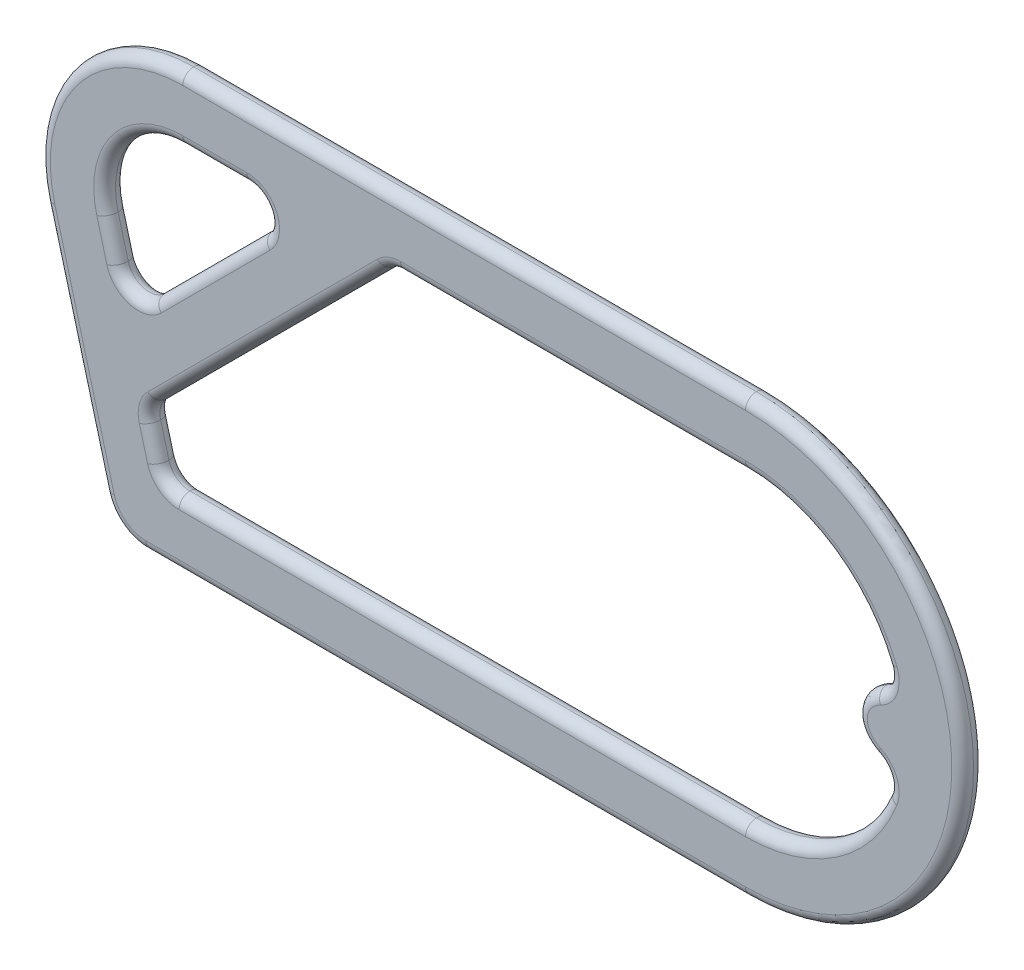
ISO-10303-21;
HEADER;
FILE_DESCRIPTION(('STEP AP214'),'2;1');
FILE_NAME('part.step','',(''),(''),'','','');
FILE_SCHEMA(('AUTOMOTIVE_DESIGN { 1 0 10303 214 1 1 1 1 }'));
ENDSEC;
DATA;
#1=APPLICATION_CONTEXT('core data for automotive mechanical design processes');
#2=APPLICATION_PROTOCOL_DEFINITION('international standard','automotive_design',2000,#1);
#3=PRODUCT_CONTEXT('',#1,'mechanical');
#4=PRODUCT('Part','Part','',(#3));
#5=PRODUCT_RELATED_PRODUCT_CATEGORY('part','',(#4));
#6=PRODUCT_DEFINITION_FORMATION('','',#4);
#7=PRODUCT_DEFINITION_CONTEXT('part definition',#1,'design');
#8=PRODUCT_DEFINITION('design','',#6,#7);
#9=PRODUCT_DEFINITION_SHAPE('','',#8);
#10=(LENGTH_UNIT() NAMED_UNIT(*) SI_UNIT(.MILLI.,.METRE.));
#11=(NAMED_UNIT(*) PLANE_ANGLE_UNIT() SI_UNIT($,.RADIAN.));
#12=(NAMED_UNIT(*) SI_UNIT($,.STERADIAN.) SOLID_ANGLE_UNIT());
#13=UNCERTAINTY_MEASURE_WITH_UNIT(LENGTH_MEASURE(1.E-05),#10,'distance_accuracy_value','');
#14=(GEOMETRIC_REPRESENTATION_CONTEXT(3) GLOBAL_UNCERTAINTY_ASSIGNED_CONTEXT((#13)) GLOBAL_UNIT_ASSIGNED_CONTEXT((#10,
#11,#12)) REPRESENTATION_CONTEXT('',''));
#15=CARTESIAN_POINT('',(0.,0.,0.));
#16=DIRECTION('',(0.,0.,1.));
#17=DIRECTION('',(1.,0.,0.));
#18=AXIS2_PLACEMENT_3D('',#15,#16,#17);
#19=CARTESIAN_POINT('',(0.,0.,12.7));
#20=DIRECTION('',(0.,0.,1.));
#21=DIRECTION('',(1.,0.,0.));
#22=AXIS2_PLACEMENT_3D('',#19,#20,#21);
#23=PLANE('',#22);
#24=CARTESIAN_POINT('',(-329.03609724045,43.18,12.7));
#25=DIRECTION('',(0.,0.,1.));
#26=DIRECTION('',(1.,0.,0.));
#27=AXIS2_PLACEMENT_3D('',#24,#25,#26);
#28=CIRCLE('',#27,52.07);
#29=CARTESIAN_POINT('',(-379.331855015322,29.7032923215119,12.7));
#30=VERTEX_POINT('',#29);
#31=CARTESIAN_POINT('',(-329.03609724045,95.25,12.7));
#32=VERTEX_POINT('',#31);
#33=EDGE_CURVE('E466',#30,#32,#28,.F.);
#34=ORIENTED_EDGE('',*,*,#33,.T.);
#35=DIRECTION('',(-1.,0.,0.));
#36=VECTOR('',#35,1.);
#37=CARTESIAN_POINT('',(0.,95.25,12.7));
#38=LINE('',#37,#36);
#39=CARTESIAN_POINT('',(-291.509880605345,95.25,12.7));
#40=VERTEX_POINT('',#39);
#41=EDGE_CURVE('E11',#32,#40,#38,.F.);
#42=ORIENTED_EDGE('',*,*,#41,.T.);
#43=CARTESIAN_POINT('',(-291.509880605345,76.2,12.7));
#44=DIRECTION('',(0.,0.,1.));
#45=DIRECTION('',(1.,0.,0.));
#46=AXIS2_PLACEMENT_3D('',#43,#44,#45);
#47=CIRCLE('',#46,19.05);
#48=CARTESIAN_POINT('',(-278.039496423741,62.7296158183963,12.7));
#49=VERTEX_POINT('',#48);
#50=EDGE_CURVE('E43',#40,#49,#47,.F.);
#51=ORIENTED_EDGE('',*,*,#50,.T.);
#52=DIRECTION('',(0.707106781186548,0.707106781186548,0.));
#53=VECTOR('',#52,1.);
#54=CARTESIAN_POINT('',(-170.384556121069,170.384556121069,12.7));
#55=LINE('',#54,#53);
#56=CARTESIAN_POINT('',(-341.57415453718,-0.805042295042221,12.7));
#57=VERTEX_POINT('',#56);
#58=EDGE_CURVE('E472',#49,#57,#55,.F.);
#59=ORIENTED_EDGE('',*,*,#58,.T.);
#60=CARTESIAN_POINT('',(-355.044538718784,12.6653418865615,12.7));
#61=DIRECTION('',(0.,0.,1.));
#62=DIRECTION('',(1.,0.,0.));
#63=AXIS2_PLACEMENT_3D('',#60,#61,#62);
#64=CIRCLE('',#63,19.05);
#65=CARTESIAN_POINT('',(-373.44542570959,7.7348390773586,12.7));
#66=VERTEX_POINT('',#65);
#67=EDGE_CURVE('E470',#57,#66,#64,.F.);
#68=ORIENTED_EDGE('',*,*,#67,.T.);
#69=DIRECTION('',(0.258819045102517,-0.96592582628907,0.));
#70=VECTOR('',#69,1.);
#71=CARTESIAN_POINT('',(-346.495615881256,-92.8432204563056,12.7));
#72=LINE('',#71,#70);
#73=EDGE_CURVE('E468',#66,#30,#72,.F.);
#74=ORIENTED_EDGE('',*,*,#73,.T.);
#75=EDGE_LOOP('',(#34,#42,#51,#59,#68,#74));
#76=FACE_BOUND('',#75,.T.);
#77=CARTESIAN_POINT('',(-331.233142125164,-76.2000000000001,12.7));
#78=DIRECTION('',(0.,0.,1.));
#79=DIRECTION('',(1.,0.,0.));
#80=AXIS2_PLACEMENT_3D('',#77,#78,#79);
#81=CIRCLE('',#80,19.05);
#82=CARTESIAN_POINT('',(-331.233142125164,-95.2500000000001,12.7));
#83=VERTEX_POINT('',#82);
#84=CARTESIAN_POINT('',(-349.634029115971,-81.1305028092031,12.7));
#85=VERTEX_POINT('',#84);
#86=EDGE_CURVE('E451',#83,#85,#81,.F.);
#87=ORIENTED_EDGE('',*,*,#86,.T.);
#88=DIRECTION('',(0.258819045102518,-0.965925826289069,0.));
#89=VECTOR('',#88,1.);
#90=CARTESIAN_POINT('',(-346.495615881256,-92.8432204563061,12.7));
#91=LINE('',#90,#89);
#92=CARTESIAN_POINT('',(-354.4679115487,-63.0902079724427,12.7));
#93=VERTEX_POINT('',#92);
#94=EDGE_CURVE('E464',#85,#93,#91,.F.);
#95=ORIENTED_EDGE('',*,*,#94,.T.);
#96=CARTESIAN_POINT('',(-336.067024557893,-58.1597051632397,12.7));
#97=DIRECTION('',(0.,0.,1.));
#98=DIRECTION('',(1.,0.,0.));
#99=AXIS2_PLACEMENT_3D('',#96,#97,#98);
#100=CIRCLE('',#99,19.05);
#101=CARTESIAN_POINT('',(-349.537408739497,-44.689320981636,12.7));
#102=VERTEX_POINT('',#101);
#103=EDGE_CURVE('E462',#93,#102,#100,.F.);
#104=ORIENTED_EDGE('',*,*,#103,.T.);
#105=DIRECTION('',(-0.707106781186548,-0.707106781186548,0.));
#106=VECTOR('',#105,1.);
#107=CARTESIAN_POINT('',(-152.42404387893,152.42404387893,12.7));
#108=LINE('',#107,#106);
#109=CARTESIAN_POINT('',(-215.177703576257,89.6703841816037,12.7));
#110=VERTEX_POINT('',#109);
#111=EDGE_CURVE('E460',#102,#110,#108,.F.);
#112=ORIENTED_EDGE('',*,*,#111,.T.);
#113=CARTESIAN_POINT('',(-201.707319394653,76.2,12.7));
#114=DIRECTION('',(0.,0.,1.));
#115=DIRECTION('',(1.,0.,0.));
#116=AXIS2_PLACEMENT_3D('',#113,#114,#115);
#117=CIRCLE('',#116,19.05);
#118=CARTESIAN_POINT('',(-201.707319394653,95.25,12.7));
#119=VERTEX_POINT('',#118);
#120=EDGE_CURVE('E458',#110,#119,#117,.F.);
#121=ORIENTED_EDGE('',*,*,#120,.T.);
#122=DIRECTION('',(-1.,0.,0.));
#123=VECTOR('',#122,1.);
#124=CARTESIAN_POINT('',(0.,95.25,12.7));
#125=LINE('',#124,#123);
#126=CARTESIAN_POINT('',(0.,95.25,12.7));
#127=VERTEX_POINT('',#126);
#128=EDGE_CURVE('E456',#119,#127,#125,.F.);
#129=ORIENTED_EDGE('',*,*,#128,.T.);
#130=CARTESIAN_POINT('',(0.,0.,12.7));
#131=DIRECTION('',(0.,0.,1.));
#132=DIRECTION('',(1.,0.,0.));
#133=AXIS2_PLACEMENT_3D('',#130,#131,#132);
#134=CIRCLE('',#133,95.25);
#135=CARTESIAN_POINT('',(88.5218235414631,35.1631804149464,12.7));
#136=VERTEX_POINT('',#135);
#137=EDGE_CURVE('E454',#127,#136,#134,.F.);
#138=ORIENTED_EDGE('',*,*,#137,.T.);
#139=CARTESIAN_POINT('',(70.8174588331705,28.1305443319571,12.7));
#140=DIRECTION('',(0.,0.,1.));
#141=DIRECTION('',(1.,0.,0.));
#142=AXIS2_PLACEMENT_3D('',#139,#140,#141);
#143=CIRCLE('',#142,19.05);
#144=CARTESIAN_POINT('',(78.9789138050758,10.9173763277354,12.7));
#145=VERTEX_POINT('',#144);
#146=EDGE_CURVE('E447',#136,#145,#143,.F.);
#147=ORIENTED_EDGE('',*,*,#146,.T.);
#148=CARTESIAN_POINT('',(84.3295159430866,-12.4833859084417,12.7));
#149=CARTESIAN_POINT('',(83.4906462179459,-18.7777323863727,12.7));
#150=CARTESIAN_POINT('',(83.4906462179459,-18.7777323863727,6.35));
#151=CARTESIAN_POINT('',(83.8693085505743,-12.4220413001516,12.7));
#152=CARTESIAN_POINT('',(82.875811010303,-18.6957238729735,12.7));
#153=CARTESIAN_POINT('',(82.875811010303,-18.6957238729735,6.35));
#154=CARTESIAN_POINT('',(83.4113041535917,-12.3437499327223,12.7));
#155=CARTESIAN_POINT('',(82.262892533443,-18.5910393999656,12.7));
#156=CARTESIAN_POINT('',(82.262892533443,-18.5910393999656,6.35));
#157=CARTESIAN_POINT('',(82.5022226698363,-12.1530564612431,12.7));
#158=CARTESIAN_POINT('',(81.0431917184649,-18.335217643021,12.7));
#159=CARTESIAN_POINT('',(81.0431917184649,-18.335217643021,6.35));
#160=CARTESIAN_POINT('',(82.051149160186,-12.0406373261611,12.7));
#161=CARTESIAN_POINT('',(80.436412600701,-18.1840571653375,12.7));
#162=CARTESIAN_POINT('',(80.436412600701,-18.1840571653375,6.35));
#163=CARTESIAN_POINT('',(81.1551248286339,-11.7804310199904,12.7));
#164=CARTESIAN_POINT('',(79.2267945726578,-17.832775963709,12.7));
#165=CARTESIAN_POINT('',(79.2267945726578,-17.832775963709,6.35));
#166=CARTESIAN_POINT('',(80.7102586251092,-11.6323513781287,12.7));
#167=CARTESIAN_POINT('',(78.6240329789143,-17.6322500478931,12.7));
#168=CARTESIAN_POINT('',(78.6240329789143,-17.6322500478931,6.35));
#169=CARTESIAN_POINT('',(79.8337948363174,-11.3011691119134,12.7));
#170=CARTESIAN_POINT('',(77.4309755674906,-17.1814419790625,12.7));
#171=CARTESIAN_POINT('',(77.4309755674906,-17.1814419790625,6.35));
#172=CARTESIAN_POINT('',(79.402195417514,-11.1180713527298,12.7));
#173=CARTESIAN_POINT('',(76.8406780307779,-16.9311667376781,12.7));
#174=CARTESIAN_POINT('',(76.8406780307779,-16.9311667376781,6.35));
#175=CARTESIAN_POINT('',(78.5546039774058,-10.7161937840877,12.7));
#176=CARTESIAN_POINT('',(75.6747652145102,-16.3783606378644,12.7));
#177=CARTESIAN_POINT('',(75.6747652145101,-16.3783606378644,6.35));
#178=CARTESIAN_POINT('',(78.1386524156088,-10.4973283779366,12.7));
#179=CARTESIAN_POINT('',(75.0991890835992,-16.0757043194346,12.7));
#180=CARTESIAN_POINT('',(75.0991890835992,-16.0757043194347,6.35));
#181=CARTESIAN_POINT('',(77.3272844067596,-10.0241386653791,12.7));
#182=CARTESIAN_POINT('',(73.9686751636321,-15.416390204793,12.7));
#183=CARTESIAN_POINT('',(73.968675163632,-15.416390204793,6.35));
#184=CARTESIAN_POINT('',(76.9318706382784,-9.76980974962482,12.7));
#185=CARTESIAN_POINT('',(73.4137400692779,-15.0597253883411,12.7));
#186=CARTESIAN_POINT('',(73.4137400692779,-15.0597253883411,6.35));
#187=CARTESIAN_POINT('',(76.167337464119,-9.22681110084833,12.7));
#188=CARTESIAN_POINT('',(72.3320685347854,-14.2914845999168,12.7));
#189=CARTESIAN_POINT('',(72.3320685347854,-14.2914845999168,6.35));
#190=CARTESIAN_POINT('',(75.7981326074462,-8.93826201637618,12.7));
#191=CARTESIAN_POINT('',(71.8052419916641,-13.8801009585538,12.7));
#192=CARTESIAN_POINT('',(71.8052419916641,-13.8801009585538,6.35));
#193=CARTESIAN_POINT('',(75.089522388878,-8.3266918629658,12.7));
#194=CARTESIAN_POINT('',(70.7847790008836,-12.9993872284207,12.7));
#195=CARTESIAN_POINT('',(70.7847790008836,-12.9993872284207,6.35));
#196=CARTESIAN_POINT('',(74.7501050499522,-8.00368476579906,12.7));
#197=CARTESIAN_POINT('',(70.2911292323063,-12.5300806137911,12.7));
#198=CARTESIAN_POINT('',(70.2911292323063,-12.5300806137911,6.35));
#199=CARTESIAN_POINT('',(74.1971522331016,-7.41998167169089,12.7));
#200=CARTESIAN_POINT('',(69.4787465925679,-11.6725099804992,12.7));
#201=CARTESIAN_POINT('',(69.4787465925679,-11.6725099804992,6.35));
#202=CARTESIAN_POINT('',(73.9750754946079,-7.16733777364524,12.7));
#203=CARTESIAN_POINT('',(69.1498898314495,-11.2986165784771,12.7));
#204=CARTESIAN_POINT('',(69.1498898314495,-11.2986165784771,6.35));
#205=CARTESIAN_POINT('',(73.5513395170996,-6.64550120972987,12.7));
#206=CARTESIAN_POINT('',(68.5175688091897,-10.5199065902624,12.7));
#207=CARTESIAN_POINT('',(68.5175688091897,-10.5199065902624,6.35));
#208=CARTESIAN_POINT('',(73.3496753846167,-6.37631253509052,12.7));
#209=CARTESIAN_POINT('',(68.2140984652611,-10.1150974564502,12.7));
#210=CARTESIAN_POINT('',(68.2140984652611,-10.1150974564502,6.35));
#211=CARTESIAN_POINT('',(72.969058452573,-5.82228023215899,12.7));
#212=CARTESIAN_POINT('',(67.6368304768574,-9.27481373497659,12.7));
#213=CARTESIAN_POINT('',(67.6368304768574,-9.27481373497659,6.35));
#214=CARTESIAN_POINT('',(72.7901065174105,-5.53743600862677,12.7));
#215=CARTESIAN_POINT('',(67.3630339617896,-8.83933798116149,12.7));
#216=CARTESIAN_POINT('',(67.3630339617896,-8.83933798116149,6.35));
#217=CARTESIAN_POINT('',(72.457315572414,-4.9533803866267,12.7));
#218=CARTESIAN_POINT('',(66.8499478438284,-7.93885685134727,12.7));
#219=CARTESIAN_POINT('',(66.8499478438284,-7.93885685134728,6.35));
#220=CARTESIAN_POINT('',(72.3034773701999,-4.65416852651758,12.7));
#221=CARTESIAN_POINT('',(66.61065935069,-7.47385052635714,12.7));
#222=CARTESIAN_POINT('',(66.61065935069,-7.47385052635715,6.35));
#223=CARTESIAN_POINT('',(72.022222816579,-4.04075135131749,12.7));
#224=CARTESIAN_POINT('',(66.1700716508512,-6.51292047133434,12.7));
#225=CARTESIAN_POINT('',(66.1700716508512,-6.51292047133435,6.35));
#226=CARTESIAN_POINT('',(71.895017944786,-3.72644872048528,12.7));
#227=CARTESIAN_POINT('',(65.9690775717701,-6.01678714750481,12.7));
#228=CARTESIAN_POINT('',(65.9690775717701,-6.01678714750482,6.35));
#229=CARTESIAN_POINT('',(71.6707910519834,-3.08721407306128,12.7));
#230=CARTESIAN_POINT('',(65.6126384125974,-5.0006257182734,12.7));
#231=CARTESIAN_POINT('',(65.6126384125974,-5.0006257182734,6.35));
#232=CARTESIAN_POINT('',(71.5737691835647,-2.76228200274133,12.7));
#233=CARTESIAN_POINT('',(65.4571935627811,-4.48059749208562,12.7));
#234=CARTESIAN_POINT('',(65.4571935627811,-4.48059749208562,6.35));
#235=CARTESIAN_POINT('',(71.4118947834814,-2.1047436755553,12.7));
#236=CARTESIAN_POINT('',(65.1967053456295,-3.42247341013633,12.7));
#237=CARTESIAN_POINT('',(65.1967053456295,-3.42247341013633,6.35));
#238=CARTESIAN_POINT('',(71.3470172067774,-1.77214360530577,12.7));
#239=CARTESIAN_POINT('',(65.0916227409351,-2.88439197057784,12.7));
#240=CARTESIAN_POINT('',(65.0916227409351,-2.88439197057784,6.35));
#241=CARTESIAN_POINT('',(71.2507218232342,-1.10214582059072,12.7));
#242=CARTESIAN_POINT('',(64.9353039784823,-1.79673941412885,12.7));
#243=CARTESIAN_POINT('',(64.9353039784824,-1.79673941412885,6.35));
#244=CARTESIAN_POINT('',(71.219299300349,-0.764748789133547,12.7));
#245=CARTESIAN_POINT('',(64.8840602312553,-1.24716992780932,12.7));
#246=CARTESIAN_POINT('',(64.8840602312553,-1.24716992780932,6.35));
#247=CARTESIAN_POINT('',(71.1924207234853,-0.131503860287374,12.7));
#248=CARTESIAN_POINT('',(64.8402297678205,-0.214628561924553,12.7));
#249=CARTESIAN_POINT('',(64.8402297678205,-0.214628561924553,6.35));
#250=CARTESIAN_POINT('',(71.1929034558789,0.16417844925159,12.7));
#251=CARTESIAN_POINT('',(64.8410196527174,0.267936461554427,12.7));
#252=CARTESIAN_POINT('',(64.8410196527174,0.267936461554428,6.35));
#253=CARTESIAN_POINT('',(71.2198667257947,0.754335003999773,12.7));
#254=CARTESIAN_POINT('',(64.8849823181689,1.23015646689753,12.7));
#255=CARTESIAN_POINT('',(64.8849823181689,1.23015646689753,6.35));
#256=CARTESIAN_POINT('',(71.2463447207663,1.04880936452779,12.7));
#257=CARTESIAN_POINT('',(64.9281509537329,1.7098117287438,12.7));
#258=CARTESIAN_POINT('',(64.9281509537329,1.7098117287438,6.35));
#259=CARTESIAN_POINT('',(71.3248389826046,1.63429521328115,12.7));
#260=CARTESIAN_POINT('',(65.0556532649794,2.66085846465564,12.7));
#261=CARTESIAN_POINT('',(65.0556532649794,2.66085846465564,6.35));
#262=CARTESIAN_POINT('',(71.3768531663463,1.92530698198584,12.7));
#263=CARTESIAN_POINT('',(65.1399835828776,3.13225060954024,12.7));
#264=CARTESIAN_POINT('',(65.1399835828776,3.13225060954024,6.35));
#265=CARTESIAN_POINT('',(71.5055609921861,2.50181268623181,12.7));
#266=CARTESIAN_POINT('',(65.3475743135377,4.06209478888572,12.7));
#267=CARTESIAN_POINT('',(65.3475743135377,4.06209478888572,6.35));
#268=CARTESIAN_POINT('',(71.5822551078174,2.7873065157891,12.7));
#269=CARTESIAN_POINT('',(65.4708354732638,4.52054657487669,12.7));
#270=CARTESIAN_POINT('',(65.4708354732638,4.52054657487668,6.35));
#271=CARTESIAN_POINT('',(71.7564946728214,3.34248743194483,12.7));
#272=CARTESIAN_POINT('',(65.7490955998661,5.40717571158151,12.7));
#273=CARTESIAN_POINT('',(65.7490955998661,5.4071757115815,6.35));
#274=CARTESIAN_POINT('',(71.8533499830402,3.61239199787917,12.7));
#275=CARTESIAN_POINT('',(65.903038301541,5.83584819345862,12.7));
#276=CARTESIAN_POINT('',(65.903038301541,5.83584819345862,6.35));
#277=CARTESIAN_POINT('',(72.0678729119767,4.14376918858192,12.7));
#278=CARTESIAN_POINT('',(66.2416645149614,6.67463469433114,12.7));
#279=CARTESIAN_POINT('',(66.2416645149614,6.67463469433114,6.35));
#280=CARTESIAN_POINT('',(72.1855398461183,4.40524209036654,12.7));
#281=CARTESIAN_POINT('',(66.426347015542,7.08474932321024,12.7));
#282=CARTESIAN_POINT('',(66.426347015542,7.08474932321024,6.35));
#283=CARTESIAN_POINT('',(72.440276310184,4.9185615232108,12.7));
#284=CARTESIAN_POINT('',(66.8232553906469,7.884562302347,12.7));
#285=CARTESIAN_POINT('',(66.8232553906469,7.88456230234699,6.35));
#286=CARTESIAN_POINT('',(72.5773472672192,5.17040734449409,12.7));
#287=CARTESIAN_POINT('',(67.0354832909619,8.27425914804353,12.7));
#288=CARTESIAN_POINT('',(67.0354832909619,8.27425914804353,6.35));
#289=CARTESIAN_POINT('',(72.869450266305,5.66355093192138,12.7));
#290=CARTESIAN_POINT('',(67.4843936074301,9.03213340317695,12.7));
#291=CARTESIAN_POINT('',(67.4843936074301,9.03213340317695,6.35));
#292=CARTESIAN_POINT('',(73.0244889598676,5.90484474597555,12.7));
#293=CARTESIAN_POINT('',(67.7210850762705,9.40030276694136,12.7));
#294=CARTESIAN_POINT('',(67.7210850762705,9.40030276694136,6.35));
#295=CARTESIAN_POINT('',(73.3691088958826,6.40213456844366,12.7));
#296=CARTESIAN_POINT('',(68.243330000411,10.1539116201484,12.7));
#297=CARTESIAN_POINT('',(68.243330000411,10.1539116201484,6.35));
#298=CARTESIAN_POINT('',(73.560614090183,6.65679898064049,12.7));
#299=CARTESIAN_POINT('',(68.5313917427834,10.5367475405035,12.7));
#300=CARTESIAN_POINT('',(68.5313917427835,10.5367475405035,6.35));
#301=CARTESIAN_POINT('',(73.961953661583,7.15130097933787,12.7));
#302=CARTESIAN_POINT('',(69.1303257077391,11.2747036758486,12.7));
#303=CARTESIAN_POINT('',(69.1303257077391,11.2747036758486,6.35));
#304=CARTESIAN_POINT('',(74.1717950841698,7.3911328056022,12.7));
#305=CARTESIAN_POINT('',(69.4412066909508,11.6298131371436,12.7));
#306=CARTESIAN_POINT('',(69.4412066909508,11.6298131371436,6.35));
#307=CARTESIAN_POINT('',(74.8258473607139,8.08729251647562,12.7));
#308=CARTESIAN_POINT('',(70.4029061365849,12.6534653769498,12.7));
#309=CARTESIAN_POINT('',(70.4029061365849,12.6534653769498,6.35));
#310=CARTESIAN_POINT('',(75.2948539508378,8.52066496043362,12.7));
#311=CARTESIAN_POINT('',(71.0831882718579,13.2809054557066,12.7));
#312=CARTESIAN_POINT('',(71.0831882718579,13.2809054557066,6.35));
#313=CARTESIAN_POINT('',(76.2778610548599,9.31737894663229,12.7));
#314=CARTESIAN_POINT('',(72.4904393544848,14.4214485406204,12.7));
#315=CARTESIAN_POINT('',(72.4904393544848,14.4214485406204,6.35));
#316=CARTESIAN_POINT('',(76.7911746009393,9.68158091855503,12.7));
#317=CARTESIAN_POINT('',(73.2166607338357,14.9359707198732,12.7));
#318=CARTESIAN_POINT('',(73.2166607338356,14.9359707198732,6.35));
#319=CARTESIAN_POINT('',(77.8576682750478,10.3469384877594,12.7));
#320=CARTESIAN_POINT('',(74.7099543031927,15.8675963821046,12.7));
#321=CARTESIAN_POINT('',(74.7099543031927,15.8675963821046,6.35));
#322=CARTESIAN_POINT('',(78.4108803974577,10.6480427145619,12.7));
#323=CARTESIAN_POINT('',(75.4770591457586,16.2846205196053,12.7));
#324=CARTESIAN_POINT('',(75.4770591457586,16.2846205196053,6.35));
#325=CARTESIAN_POINT('',(79.400642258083,11.1173392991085,12.7));
#326=CARTESIAN_POINT('',(76.8385457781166,16.9301555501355,12.7));
#327=CARTESIAN_POINT('',(76.8385457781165,16.9301555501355,6.35));
#328=CARTESIAN_POINT('',(79.8305403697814,11.2997899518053,12.7));
#329=CARTESIAN_POINT('',(77.426525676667,17.1795556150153,12.7));
#330=CARTESIAN_POINT('',(77.426525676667,17.1795556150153,6.35));
#331=CARTESIAN_POINT('',(80.7036930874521,11.6300182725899,12.7));
#332=CARTESIAN_POINT('',(78.6151154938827,17.6290831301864,12.7));
#333=CARTESIAN_POINT('',(78.6151154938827,17.6290831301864,6.35));
#334=CARTESIAN_POINT('',(81.1469535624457,11.7777804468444,12.7));
#335=CARTESIAN_POINT('',(79.2157309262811,17.8291885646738,12.7));
#336=CARTESIAN_POINT('',(79.2157309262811,17.8291885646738,6.35));
#337=CARTESIAN_POINT('',(82.0429720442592,12.0385340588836,12.7));
#338=CARTESIAN_POINT('',(80.4254054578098,18.1812267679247,12.7));
#339=CARTESIAN_POINT('',(80.4254054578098,18.1812267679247,6.35));
#340=CARTESIAN_POINT('',(82.4957182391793,12.1515662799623,12.7));
#341=CARTESIAN_POINT('',(81.0344537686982,18.3332160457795,12.7));
#342=CARTESIAN_POINT('',(81.0344537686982,18.3332160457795,6.35));
#343=CARTESIAN_POINT('',(83.4080779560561,12.3431974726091,12.7));
#344=CARTESIAN_POINT('',(82.2585749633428,18.5903004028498,12.7));
#345=CARTESIAN_POINT('',(82.2585749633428,18.5903004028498,6.35));
#346=CARTESIAN_POINT('',(83.8676858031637,12.421823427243,12.7));
#347=CARTESIAN_POINT('',(82.873642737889,18.6954322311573,12.7));
#348=CARTESIAN_POINT('',(82.8736427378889,18.6954322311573,6.35));
#349=CARTESIAN_POINT('',(84.3295159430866,12.4833859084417,12.7));
#350=CARTESIAN_POINT('',(83.4906463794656,18.777732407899,12.7));
#351=CARTESIAN_POINT('',(83.4906463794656,18.777732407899,6.35));
#352=(BOUNDED_SURFACE() B_SPLINE_SURFACE(3,2,((#148,#149,#150),(#151,#152,#153),(#154,#155,
#156),(#157,#158,#159),(#160,#161,#162),(#163,#164,#165),(#166,#167,#168),(#169,#170,#171),
(#172,#173,#174),(#175,#176,#177),(#178,#179,#180),(#181,#182,#183),(#184,#185,#186),(#187,#188,
#189),(#190,#191,#192),(#193,#194,#195),(#196,#197,#198),(#199,#200,#201),(#202,#203,#204),
(#205,#206,#207),(#208,#209,#210),(#211,#212,#213),(#214,#215,#216),(#217,#218,#219),(#220,#221,
#222),(#223,#224,#225),(#226,#227,#228),(#229,#230,#231),(#232,#233,#234),(#235,#236,#237),
(#238,#239,#240),(#241,#242,#243),(#244,#245,#246),(#247,#248,#249),(#250,#251,#252),(#253,#254,
#255),(#256,#257,#258),(#259,#260,#261),(#262,#263,#264),(#265,#266,#267),(#268,#269,#270),
(#271,#272,#273),(#274,#275,#276),(#277,#278,#279),(#280,#281,#282),(#283,#284,#285),(#286,#287,
#288),(#289,#290,#291),(#292,#293,#294),(#295,#296,#297),(#298,#299,#300),(#301,#302,#303),
(#304,#305,#306),(#307,#308,#309),(#310,#311,#312),(#313,#314,#315),(#316,#317,#318),(#319,#320,
#321),(#322,#323,#324),(#325,#326,#327),(#328,#329,#330),(#331,#332,#333),(#334,#335,#336),
(#337,#338,#339),(#340,#341,#342),(#343,#344,#345),(#346,#347,#348),(#349,#350,#351)),
.UNSPECIFIED.,.F.,.F.,.F.) B_SPLINE_SURFACE_WITH_KNOTS((4,2,2,2,2,2,2,2,2,2,2,2,2,2,2,2,2,2,2,2,
2,2,2,2,2,2,2,2,2,2,2,2,2,4),(3,3),(0.,1.3926030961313,2.78590229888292,4.19104307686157,
5.59598877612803,7.00434730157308,8.41288904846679,9.81660467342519,11.2197532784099,
12.2279523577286,13.2359091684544,14.2439043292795,15.251931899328,16.2676831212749,
17.2834394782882,18.2984031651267,19.3132237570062,20.1991517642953,21.0849931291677,
21.9707622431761,22.8565483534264,23.7159149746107,24.5752533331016,25.4346549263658,
26.294375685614,27.2493162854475,28.2046254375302,30.1138613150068,31.997518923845,
33.8827041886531,35.2823336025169,36.6825869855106,38.0811897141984,39.4786936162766),(0.,1.),
.UNSPECIFIED.) GEOMETRIC_REPRESENTATION_ITEM() RATIONAL_B_SPLINE_SURFACE(((1.,0.707106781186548,
1.),(1.,0.707106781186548,1.),(1.,0.707106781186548,1.),(1.,0.707106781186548,1.),(1.,
0.707106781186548,1.),(1.,0.707106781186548,1.),(1.,0.707106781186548,1.),(1.,0.707106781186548,
1.),(1.,0.707106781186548,1.),(1.,0.707106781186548,1.),(1.,0.707106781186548,1.),(1.,
0.707106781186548,1.),(1.,0.707106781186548,1.),(1.,0.707106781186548,1.),(1.,0.707106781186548,
1.),(1.,0.707106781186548,1.),(1.,0.707106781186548,1.),(1.,0.707106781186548,1.),(1.,
0.707106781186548,1.),(1.,0.707106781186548,1.),(1.,0.707106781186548,1.),(1.,0.707106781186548,
1.),(1.,0.707106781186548,1.),(1.,0.707106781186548,1.),(1.,0.707106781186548,1.),(1.,
0.707106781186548,1.),(1.,0.707106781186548,1.),(1.,0.707106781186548,1.),(1.,0.707106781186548,
1.),(1.,0.707106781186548,1.),(1.,0.707106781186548,1.),(1.,0.707106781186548,1.),(1.,
0.707106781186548,1.),(1.,0.707106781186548,1.),(1.,0.707106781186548,1.),(1.,0.707106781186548,
1.),(1.,0.707106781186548,1.),(1.,0.707106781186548,1.),(1.,0.707106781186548,1.),(1.,
0.707106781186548,1.),(1.,0.707106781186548,1.),(1.,0.707106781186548,1.),(1.,0.707106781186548,
1.),(1.,0.707106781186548,1.),(1.,0.707106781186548,1.),(1.,0.707106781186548,1.),(1.,
0.707106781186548,1.),(1.,0.707106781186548,1.),(1.,0.707106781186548,1.),(1.,0.707106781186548,
1.),(1.,0.707106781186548,1.),(1.,0.707106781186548,1.),(1.,0.707106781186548,1.),(1.,
0.707106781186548,1.),(1.,0.707106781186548,1.),(1.,0.707106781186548,1.),(1.,0.707106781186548,
1.),(1.,0.707106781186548,1.),(1.,0.707106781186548,1.),(1.,0.707106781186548,1.),(1.,
0.707106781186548,1.),(1.,0.707106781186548,1.),(1.,0.707106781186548,1.),(1.,0.707106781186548,
1.),(1.,0.707106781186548,1.),(1.,0.707106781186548,1.),(1.,0.707106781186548,1.),(1.,
0.707106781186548,1.))) REPRESENTATION_ITEM('') SURFACE());
#353=CARTESIAN_POINT('',(84.3295159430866,12.4833859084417,12.7));
#354=CARTESIAN_POINT('',(83.8676858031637,12.421823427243,12.7));
#355=CARTESIAN_POINT('',(83.4080779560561,12.3431974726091,12.7));
#356=CARTESIAN_POINT('',(82.4957182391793,12.1515662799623,12.7));
#357=CARTESIAN_POINT('',(82.0429720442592,12.0385340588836,12.7));
#358=CARTESIAN_POINT('',(81.1469535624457,11.7777804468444,12.7));
#359=CARTESIAN_POINT('',(80.7036930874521,11.6300182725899,12.7));
#360=CARTESIAN_POINT('',(79.8305403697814,11.2997899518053,12.7));
#361=CARTESIAN_POINT('',(79.400642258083,11.1173392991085,12.7));
#362=CARTESIAN_POINT('',(78.4108803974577,10.6480427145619,12.7));
#363=CARTESIAN_POINT('',(77.8576682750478,10.3469384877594,12.7));
#364=CARTESIAN_POINT('',(76.7911746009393,9.68158091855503,12.7));
#365=CARTESIAN_POINT('',(76.2778610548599,9.31737894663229,12.7));
#366=CARTESIAN_POINT('',(75.2948539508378,8.52066496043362,12.7));
#367=CARTESIAN_POINT('',(74.8258473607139,8.08729251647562,12.7));
#368=CARTESIAN_POINT('',(74.1717950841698,7.3911328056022,12.7));
#369=CARTESIAN_POINT('',(73.961953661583,7.15130097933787,12.7));
#370=CARTESIAN_POINT('',(73.560614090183,6.65679898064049,12.7));
#371=CARTESIAN_POINT('',(73.3691088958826,6.40213456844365,12.7));
#372=CARTESIAN_POINT('',(73.0244889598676,5.90484474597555,12.7));
#373=CARTESIAN_POINT('',(72.869450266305,5.66355093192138,12.7));
#374=CARTESIAN_POINT('',(72.5773472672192,5.17040734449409,12.7));
#375=CARTESIAN_POINT('',(72.440276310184,4.9185615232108,12.7));
#376=CARTESIAN_POINT('',(72.1855398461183,4.40524209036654,12.7));
#377=CARTESIAN_POINT('',(72.0678729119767,4.14376918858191,12.7));
#378=CARTESIAN_POINT('',(71.8533499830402,3.61239199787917,12.7));
#379=CARTESIAN_POINT('',(71.7564946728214,3.34248743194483,12.7));
#380=CARTESIAN_POINT('',(71.5822551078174,2.78730651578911,12.7));
#381=CARTESIAN_POINT('',(71.5055609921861,2.50181268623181,12.7));
#382=CARTESIAN_POINT('',(71.3768531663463,1.92530698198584,12.7));
#383=CARTESIAN_POINT('',(71.3248389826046,1.63429521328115,12.7));
#384=CARTESIAN_POINT('',(71.2463447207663,1.04880936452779,12.7));
#385=CARTESIAN_POINT('',(71.2198667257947,0.754335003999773,12.7));
#386=CARTESIAN_POINT('',(71.1929034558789,0.164178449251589,12.7));
#387=CARTESIAN_POINT('',(71.1924207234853,-0.131503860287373,12.7));
#388=CARTESIAN_POINT('',(71.2192993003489,-0.764748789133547,12.7));
#389=CARTESIAN_POINT('',(71.2507218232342,-1.10214582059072,12.7));
#390=CARTESIAN_POINT('',(71.3470172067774,-1.77214360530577,12.7));
#391=CARTESIAN_POINT('',(71.4118947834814,-2.1047436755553,12.7));
#392=CARTESIAN_POINT('',(71.5737691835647,-2.76228200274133,12.7));
#393=CARTESIAN_POINT('',(71.6707910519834,-3.08721407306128,12.7));
#394=CARTESIAN_POINT('',(71.895017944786,-3.72644872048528,12.7));
#395=CARTESIAN_POINT('',(72.022222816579,-4.04075135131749,12.7));
#396=CARTESIAN_POINT('',(72.3034773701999,-4.65416852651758,12.7));
#397=CARTESIAN_POINT('',(72.457315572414,-4.9533803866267,12.7));
#398=CARTESIAN_POINT('',(72.7901065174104,-5.53743600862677,12.7));
#399=CARTESIAN_POINT('',(72.969058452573,-5.82228023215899,12.7));
#400=CARTESIAN_POINT('',(73.3496753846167,-6.37631253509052,12.7));
#401=CARTESIAN_POINT('',(73.5513395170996,-6.64550120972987,12.7));
#402=CARTESIAN_POINT('',(73.9750754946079,-7.16733777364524,12.7));
#403=CARTESIAN_POINT('',(74.1971522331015,-7.41998167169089,12.7));
#404=CARTESIAN_POINT('',(74.7501050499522,-8.00368476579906,12.7));
#405=CARTESIAN_POINT('',(75.089522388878,-8.3266918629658,12.7));
#406=CARTESIAN_POINT('',(75.7981326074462,-8.93826201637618,12.7));
#407=CARTESIAN_POINT('',(76.167337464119,-9.22681110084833,12.7));
#408=CARTESIAN_POINT('',(76.9318706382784,-9.76980974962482,12.7));
#409=CARTESIAN_POINT('',(77.3272844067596,-10.0241386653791,12.7));
#410=CARTESIAN_POINT('',(78.1386524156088,-10.4973283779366,12.7));
#411=CARTESIAN_POINT('',(78.5546039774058,-10.7161937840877,12.7));
#412=CARTESIAN_POINT('',(79.402195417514,-11.1180713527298,12.7));
#413=CARTESIAN_POINT('',(79.8337948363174,-11.3011691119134,12.7));
#414=CARTESIAN_POINT('',(80.7102586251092,-11.6323513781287,12.7));
#415=CARTESIAN_POINT('',(81.1551248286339,-11.7804310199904,12.7));
#416=CARTESIAN_POINT('',(82.051149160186,-12.0406373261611,12.7));
#417=CARTESIAN_POINT('',(82.5022226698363,-12.1530564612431,12.7));
#418=CARTESIAN_POINT('',(83.4113041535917,-12.3437499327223,12.7));
#419=CARTESIAN_POINT('',(83.8693085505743,-12.4220413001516,12.7));
#420=CARTESIAN_POINT('',(84.3295159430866,-12.4833859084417,12.7));
#421=B_SPLINE_CURVE_WITH_KNOTS('',3,(#353,#354,#355,#356,#357,#358,#359,#360,#361,#362,#363,
#364,#365,#366,#367,#368,#369,#370,#371,#372,#373,#374,#375,#376,#377,#378,#379,#380,#381,#382,
#383,#384,#385,#386,#387,#388,#389,#390,#391,#392,#393,#394,#395,#396,#397,#398,#399,#400,#401,
#402,#403,#404,#405,#406,#407,#408,#409,#410,#411,#412,#413,#414,#415,#416,#417,#418,#419,#420),
.UNSPECIFIED.,.F.,.F.,(4,2,2,2,2,2,2,2,2,2,2,2,2,2,2,2,2,2,2,2,2,2,2,2,2,2,2,2,2,2,2,2,2,4),(0.,
1.39750390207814,2.796106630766,4.19636001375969,5.5959894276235,7.4811746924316,
9.36483230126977,11.2740681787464,12.229377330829,13.1843179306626,14.0440386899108,
14.9034402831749,15.7627786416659,16.6221452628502,17.5079313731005,18.3937004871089,
19.2795418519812,20.1654698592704,21.1802904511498,22.1952541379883,23.2110104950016,
24.2267617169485,25.2347892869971,26.2427844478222,27.250741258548,28.2589403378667,
29.6620889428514,31.0658045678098,32.4743463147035,33.8827048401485,35.287650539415,
36.6927913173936,38.0860905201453,39.4786936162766),.UNSPECIFIED.);
#422=CARTESIAN_POINT('',(78.9789138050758,-10.9173763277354,12.7));
#423=VERTEX_POINT('',#422);
#424=EDGE_CURVE('E441',#145,#423,#421,.T.);
#425=ORIENTED_EDGE('',*,*,#424,.T.);
#426=CARTESIAN_POINT('',(70.8174588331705,-28.1305443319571,12.7));
#427=DIRECTION('',(0.,0.,1.));
#428=DIRECTION('',(1.,0.,0.));
#429=AXIS2_PLACEMENT_3D('',#426,#427,#428);
#430=CIRCLE('',#429,19.05);
#431=CARTESIAN_POINT('',(88.5218235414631,-35.1631804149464,12.7));
#432=VERTEX_POINT('',#431);
#433=EDGE_CURVE('E448',#423,#432,#430,.F.);
#434=ORIENTED_EDGE('',*,*,#433,.T.);
#435=CARTESIAN_POINT('',(0.,0.,12.7));
#436=DIRECTION('',(0.,0.,1.));
#437=DIRECTION('',(1.,0.,0.));
#438=AXIS2_PLACEMENT_3D('',#435,#436,#437);
#439=CIRCLE('',#438,95.25);
#440=CARTESIAN_POINT('',(0.,-95.25,12.7));
#441=VERTEX_POINT('',#440);
#442=EDGE_CURVE('E562',#432,#441,#439,.F.);
#443=ORIENTED_EDGE('',*,*,#442,.T.);
#444=DIRECTION('',(1.,0.,0.));
#445=VECTOR('',#444,1.);
#446=CARTESIAN_POINT('',(0.,-95.25,12.7));
#447=LINE('',#446,#445);
#448=EDGE_CURVE('E561',#441,#83,#447,.F.);
#449=ORIENTED_EDGE('',*,*,#448,.T.);
#450=EDGE_LOOP('',(#87,#95,#104,#112,#121,#129,#138,#147,#425,#434,#443,#449));
#451=FACE_BOUND('',#450,.T.);
#452=DIRECTION('',(1.,0.,0.));
#453=VECTOR('',#452,1.);
#454=CARTESIAN_POINT('',(0.,-120.65,12.7));
#455=LINE('',#454,#453);
#456=CARTESIAN_POINT('',(-350.72324761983,-120.65,12.7));
#457=VERTEX_POINT('',#456);
#458=CARTESIAN_POINT('',(0.,-120.65,12.7));
#459=VERTEX_POINT('',#458);
#460=EDGE_CURVE('E549',#457,#459,#455,.T.);
#461=ORIENTED_EDGE('',*,*,#460,.T.);
#462=CARTESIAN_POINT('',(0.,0.,12.7));
#463=DIRECTION('',(0.,0.,1.));
#464=DIRECTION('',(1.,0.,0.));
#465=AXIS2_PLACEMENT_3D('',#462,#463,#464);
#466=CIRCLE('',#465,120.65);
#467=CARTESIAN_POINT('',(0.,120.65,12.7));
#468=VERTEX_POINT('',#467);
#469=EDGE_CURVE('E558',#459,#468,#466,.T.);
#470=ORIENTED_EDGE('',*,*,#469,.T.);
#471=DIRECTION('',(-1.,0.,0.));
#472=VECTOR('',#471,1.);
#473=CARTESIAN_POINT('',(-329.03609724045,120.65,12.7));
#474=LINE('',#473,#472);
#475=CARTESIAN_POINT('',(-329.03609724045,120.65,12.7));
#476=VERTEX_POINT('',#475);
#477=EDGE_CURVE('E556',#468,#476,#474,.T.);
#478=ORIENTED_EDGE('',*,*,#477,.T.);
#479=CARTESIAN_POINT('',(-329.03609724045,43.18,12.7));
#480=DIRECTION('',(0.,0.,1.));
#481=DIRECTION('',(1.,0.,0.));
#482=AXIS2_PLACEMENT_3D('',#479,#480,#481);
#483=CIRCLE('',#482,77.47);
#484=CARTESIAN_POINT('',(-403.866371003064,23.1292885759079,12.7));
#485=VERTEX_POINT('',#484);
#486=EDGE_CURVE('E274',#476,#485,#483,.T.);
#487=ORIENTED_EDGE('',*,*,#486,.T.);
#488=DIRECTION('',(0.258819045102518,-0.965925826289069,0.));
#489=VECTOR('',#488,1.);
#490=CARTESIAN_POINT('',(-369.124134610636,-106.530502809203,12.7));
#491=LINE('',#490,#489);
#492=CARTESIAN_POINT('',(-369.124134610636,-106.530502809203,12.7));
#493=VERTEX_POINT('',#492);
#494=EDGE_CURVE('E553',#485,#493,#491,.T.);
#495=ORIENTED_EDGE('',*,*,#494,.T.);
#496=CARTESIAN_POINT('',(-350.72324761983,-101.6,12.7));
#497=DIRECTION('',(0.,0.,1.));
#498=DIRECTION('',(1.,0.,0.));
#499=AXIS2_PLACEMENT_3D('',#496,#497,#498);
#500=CIRCLE('',#499,19.0499999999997);
#501=EDGE_CURVE('E551',#493,#457,#500,.T.);
#502=ORIENTED_EDGE('',*,*,#501,.T.);
#503=EDGE_LOOP('',(#461,#470,#478,#487,#495,#502));
#504=FACE_BOUND('',#503,.T.);
#505=ADVANCED_FACE('F34',(#76,#451,#504),#23,.T.);
#506=CARTESIAN_POINT('',(0.,0.,0.));
#507=DIRECTION('',(0.,0.,1.));
#508=DIRECTION('',(1.,0.,0.));
#509=AXIS2_PLACEMENT_3D('',#506,#507,#508);
#510=PLANE('',#509);
#511=CARTESIAN_POINT('',(-291.509880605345,76.2,0.));
#512=DIRECTION('',(0.,0.,1.));
#513=DIRECTION('',(1.,0.,0.));
#514=AXIS2_PLACEMENT_3D('',#511,#512,#513);
#515=CIRCLE('',#514,19.05);
#516=CARTESIAN_POINT('',(-278.039496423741,62.7296158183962,0.));
#517=VERTEX_POINT('',#516);
#518=CARTESIAN_POINT('',(-291.509880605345,95.25,0.));
#519=VERTEX_POINT('',#518);
#520=EDGE_CURVE('E544',#517,#519,#515,.T.);
#521=ORIENTED_EDGE('',*,*,#520,.T.);
#522=DIRECTION('',(-1.,0.,0.));
#523=VECTOR('',#522,1.);
#524=CARTESIAN_POINT('',(-329.03609724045,95.25,0.));
#525=LINE('',#524,#523);
#526=CARTESIAN_POINT('',(-329.03609724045,95.25,0.));
#527=VERTEX_POINT('',#526);
#528=EDGE_CURVE('E546',#519,#527,#525,.T.);
#529=ORIENTED_EDGE('',*,*,#528,.T.);
#530=CARTESIAN_POINT('',(-329.03609724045,43.18,0.));
#531=DIRECTION('',(0.,0.,1.));
#532=DIRECTION('',(1.,0.,0.));
#533=AXIS2_PLACEMENT_3D('',#530,#531,#532);
#534=CIRCLE('',#533,52.07);
#535=CARTESIAN_POINT('',(-379.331855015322,29.7032923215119,0.));
#536=VERTEX_POINT('',#535);
#537=EDGE_CURVE('E536',#527,#536,#534,.T.);
#538=ORIENTED_EDGE('',*,*,#537,.T.);
#539=DIRECTION('',(0.258819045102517,-0.96592582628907,0.));
#540=VECTOR('',#539,1.);
#541=CARTESIAN_POINT('',(-373.44542570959,7.73483907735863,0.));
#542=LINE('',#541,#540);
#543=CARTESIAN_POINT('',(-373.44542570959,7.7348390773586,0.));
#544=VERTEX_POINT('',#543);
#545=EDGE_CURVE('E538',#536,#544,#542,.T.);
#546=ORIENTED_EDGE('',*,*,#545,.T.);
#547=CARTESIAN_POINT('',(-355.044538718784,12.6653418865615,0.));
#548=DIRECTION('',(0.,0.,1.));
#549=DIRECTION('',(1.,0.,0.));
#550=AXIS2_PLACEMENT_3D('',#547,#548,#549);
#551=CIRCLE('',#550,19.05);
#552=CARTESIAN_POINT('',(-341.57415453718,-0.805042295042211,0.));
#553=VERTEX_POINT('',#552);
#554=EDGE_CURVE('E540',#544,#553,#551,.T.);
#555=ORIENTED_EDGE('',*,*,#554,.T.);
#556=DIRECTION('',(0.707106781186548,0.707106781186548,0.));
#557=VECTOR('',#556,1.);
#558=CARTESIAN_POINT('',(-278.039496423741,62.7296158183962,0.));
#559=LINE('',#558,#557);
#560=EDGE_CURVE('E542',#553,#517,#559,.T.);
#561=ORIENTED_EDGE('',*,*,#560,.T.);
#562=EDGE_LOOP('',(#521,#529,#538,#546,#555,#561));
#563=FACE_BOUND('',#562,.T.);
#564=CARTESIAN_POINT('',(-336.067024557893,-58.1597051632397,0.));
#565=DIRECTION('',(0.,0.,1.));
#566=DIRECTION('',(1.,0.,0.));
#567=AXIS2_PLACEMENT_3D('',#564,#565,#566);
#568=CIRCLE('',#567,19.05);
#569=CARTESIAN_POINT('',(-349.537408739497,-44.689320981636,0.));
#570=VERTEX_POINT('',#569);
#571=CARTESIAN_POINT('',(-354.4679115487,-63.0902079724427,0.));
#572=VERTEX_POINT('',#571);
#573=EDGE_CURVE('E532',#570,#572,#568,.T.);
#574=ORIENTED_EDGE('',*,*,#573,.T.);
#575=DIRECTION('',(0.258819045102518,-0.965925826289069,0.));
#576=VECTOR('',#575,1.);
#577=CARTESIAN_POINT('',(-349.634029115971,-81.1305028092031,0.));
#578=LINE('',#577,#576);
#579=CARTESIAN_POINT('',(-349.634029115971,-81.1305028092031,0.));
#580=VERTEX_POINT('',#579);
#581=EDGE_CURVE('E534',#572,#580,#578,.T.);
#582=ORIENTED_EDGE('',*,*,#581,.T.);
#583=CARTESIAN_POINT('',(-331.233142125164,-76.2000000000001,0.));
#584=DIRECTION('',(0.,0.,1.));
#585=DIRECTION('',(1.,0.,0.));
#586=AXIS2_PLACEMENT_3D('',#583,#584,#585);
#587=CIRCLE('',#586,19.05);
#588=CARTESIAN_POINT('',(-331.233142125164,-95.2500000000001,0.));
#589=VERTEX_POINT('',#588);
#590=EDGE_CURVE('E521',#580,#589,#587,.T.);
#591=ORIENTED_EDGE('',*,*,#590,.T.);
#592=DIRECTION('',(1.,0.,0.));
#593=VECTOR('',#592,1.);
#594=CARTESIAN_POINT('',(0.,-95.25,0.));
#595=LINE('',#594,#593);
#596=CARTESIAN_POINT('',(0.,-95.25,0.));
#597=VERTEX_POINT('',#596);
#598=EDGE_CURVE('E510',#589,#597,#595,.T.);
#599=ORIENTED_EDGE('',*,*,#598,.T.);
#600=CARTESIAN_POINT('',(0.,0.,0.));
#601=DIRECTION('',(0.,0.,1.));
#602=DIRECTION('',(1.,0.,0.));
#603=AXIS2_PLACEMENT_3D('',#600,#601,#602);
#604=CIRCLE('',#603,95.25);
#605=CARTESIAN_POINT('',(88.5218235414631,-35.1631804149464,0.));
#606=VERTEX_POINT('',#605);
#607=EDGE_CURVE('E508',#597,#606,#604,.T.);
#608=ORIENTED_EDGE('',*,*,#607,.T.);
#609=CARTESIAN_POINT('',(70.8174588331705,-28.1305443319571,0.));
#610=DIRECTION('',(0.,0.,1.));
#611=DIRECTION('',(1.,0.,0.));
#612=AXIS2_PLACEMENT_3D('',#609,#610,#611);
#613=CIRCLE('',#612,19.05);
#614=CARTESIAN_POINT('',(78.9789138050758,-10.9173763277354,0.));
#615=VERTEX_POINT('',#614);
#616=EDGE_CURVE('E512',#606,#615,#613,.T.);
#617=ORIENTED_EDGE('',*,*,#616,.T.);
#618=CARTESIAN_POINT('',(84.3295159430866,12.4833859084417,0.));
#619=CARTESIAN_POINT('',(83.4906463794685,18.7777324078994,0.));
#620=CARTESIAN_POINT('',(83.4906463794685,18.7777324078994,6.35));
#621=CARTESIAN_POINT('',(83.8693085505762,12.4220413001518,0.));
#622=CARTESIAN_POINT('',(82.8758110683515,18.6957238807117,0.));
#623=CARTESIAN_POINT('',(82.8758110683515,18.6957238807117,6.35));
#624=CARTESIAN_POINT('',(83.4113041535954,12.343749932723,0.));
#625=CARTESIAN_POINT('',(82.2628925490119,18.5910394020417,0.));
#626=CARTESIAN_POINT('',(82.2628925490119,18.5910394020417,6.35));
#627=CARTESIAN_POINT('',(82.5022226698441,12.1530564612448,0.));
#628=CARTESIAN_POINT('',(81.0431917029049,18.3352176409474,0.));
#629=CARTESIAN_POINT('',(81.0431917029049,18.3352176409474,6.35));
#630=CARTESIAN_POINT('',(82.0511491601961,12.0406373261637,0.));
#631=CARTESIAN_POINT('',(80.4364125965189,18.1840571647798,0.));
#632=CARTESIAN_POINT('',(80.4364125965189,18.1840571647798,6.35));
#633=CARTESIAN_POINT('',(81.1551248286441,11.7804310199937,0.));
#634=CARTESIAN_POINT('',(79.2267945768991,17.8327759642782,0.));
#635=CARTESIAN_POINT('',(79.2267945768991,17.8327759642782,6.35));
#636=CARTESIAN_POINT('',(80.7102586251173,11.6323513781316,0.));
#637=CARTESIAN_POINT('',(78.6240329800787,17.6322500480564,0.));
#638=CARTESIAN_POINT('',(78.6240329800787,17.6322500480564,6.35));
#639=CARTESIAN_POINT('',(79.8337948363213,11.3011691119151,0.));
#640=CARTESIAN_POINT('',(77.4309755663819,17.1814419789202,0.));
#641=CARTESIAN_POINT('',(77.4309755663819,17.1814419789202,6.35));
#642=CARTESIAN_POINT('',(79.4021954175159,11.1180713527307,0.));
#643=CARTESIAN_POINT('',(76.8406780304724,16.9311667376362,0.));
#644=CARTESIAN_POINT('',(76.8406780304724,16.9311667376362,6.35));
#645=CARTESIAN_POINT('',(78.5546039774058,10.7161937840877,0.));
#646=CARTESIAN_POINT('',(75.6747652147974,16.3783606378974,0.));
#647=CARTESIAN_POINT('',(75.6747652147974,16.3783606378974,6.35));
#648=CARTESIAN_POINT('',(78.1386524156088,10.4973283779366,0.));
#649=CARTESIAN_POINT('',(75.0991890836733,16.0757043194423,0.));
#650=CARTESIAN_POINT('',(75.0991890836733,16.0757043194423,6.35));
#651=CARTESIAN_POINT('',(77.3272844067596,10.0241386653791,0.));
#652=CARTESIAN_POINT('',(73.9686751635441,15.4163902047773,0.));
#653=CARTESIAN_POINT('',(73.9686751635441,15.4163902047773,6.35));
#654=CARTESIAN_POINT('',(76.9318706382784,9.76980974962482,0.));
#655=CARTESIAN_POINT('',(73.413740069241,15.0597253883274,0.));
#656=CARTESIAN_POINT('',(73.413740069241,15.0597253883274,6.35));
#657=CARTESIAN_POINT('',(76.167337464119,9.22681110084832,0.));
#658=CARTESIAN_POINT('',(72.3320685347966,14.2914845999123,0.));
#659=CARTESIAN_POINT('',(72.3320685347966,14.2914845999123,6.35));
#660=CARTESIAN_POINT('',(75.7981326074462,8.93826201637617,0.));
#661=CARTESIAN_POINT('',(71.8052419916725,13.8801009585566,0.));
#662=CARTESIAN_POINT('',(71.8052419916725,13.8801009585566,6.35));
#663=CARTESIAN_POINT('',(75.089522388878,8.32669186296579,0.));
#664=CARTESIAN_POINT('',(70.7847790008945,12.9993872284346,0.));
#665=CARTESIAN_POINT('',(70.7847790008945,12.9993872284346,6.35));
#666=CARTESIAN_POINT('',(74.7501050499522,8.00368476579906,0.));
#667=CARTESIAN_POINT('',(70.2911292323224,12.5300806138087,0.));
#668=CARTESIAN_POINT('',(70.2911292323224,12.5300806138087,6.35));
#669=CARTESIAN_POINT('',(74.1971522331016,7.41998167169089,0.));
#670=CARTESIAN_POINT('',(69.4787465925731,11.6725099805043,0.));
#671=CARTESIAN_POINT('',(69.4787465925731,11.6725099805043,6.35));
#672=CARTESIAN_POINT('',(73.9750754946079,7.16733777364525,0.));
#673=CARTESIAN_POINT('',(69.1498898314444,11.2986165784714,0.));
#674=CARTESIAN_POINT('',(69.1498898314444,11.2986165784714,6.35));
#675=CARTESIAN_POINT('',(73.5513395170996,6.64550120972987,0.));
#676=CARTESIAN_POINT('',(68.5175688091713,10.5199065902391,0.));
#677=CARTESIAN_POINT('',(68.5175688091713,10.5199065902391,6.35));
#678=CARTESIAN_POINT('',(73.3496753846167,6.37631253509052,0.));
#679=CARTESIAN_POINT('',(68.2140984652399,10.1150974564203,0.));
#680=CARTESIAN_POINT('',(68.2140984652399,10.1150974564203,6.35));
#681=CARTESIAN_POINT('',(72.969058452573,5.82228023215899,0.));
#682=CARTESIAN_POINT('',(67.6368304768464,9.2748137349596,0.));
#683=CARTESIAN_POINT('',(67.6368304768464,9.27481373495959,6.35));
#684=CARTESIAN_POINT('',(72.7901065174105,5.53743600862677,0.));
#685=CARTESIAN_POINT('',(67.3630339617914,8.83933798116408,0.));
#686=CARTESIAN_POINT('',(67.3630339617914,8.83933798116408,6.35));
#687=CARTESIAN_POINT('',(72.457315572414,4.9533803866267,0.));
#688=CARTESIAN_POINT('',(66.8499478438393,7.93885685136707,0.));
#689=CARTESIAN_POINT('',(66.8499478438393,7.93885685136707,6.35));
#690=CARTESIAN_POINT('',(72.3034773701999,4.65416852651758,0.));
#691=CARTESIAN_POINT('',(66.6106593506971,7.47385052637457,0.));
#692=CARTESIAN_POINT('',(66.610659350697,7.47385052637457,6.35));
#693=CARTESIAN_POINT('',(72.022222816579,4.0407513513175,0.));
#694=CARTESIAN_POINT('',(66.170071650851,6.51292047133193,0.));
#695=CARTESIAN_POINT('',(66.170071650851,6.51292047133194,6.35));
#696=CARTESIAN_POINT('',(71.895017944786,3.72644872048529,0.));
#697=CARTESIAN_POINT('',(65.9690775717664,6.01678714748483,0.));
#698=CARTESIAN_POINT('',(65.9690775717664,6.01678714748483,6.35));
#699=CARTESIAN_POINT('',(71.6707910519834,3.08721407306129,0.));
#700=CARTESIAN_POINT('',(65.6126384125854,5.00062571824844,0.));
#701=CARTESIAN_POINT('',(65.6126384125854,5.00062571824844,6.35));
#702=CARTESIAN_POINT('',(71.5737691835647,2.76228200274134,0.));
#703=CARTESIAN_POINT('',(65.4571935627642,4.48059749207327,0.));
#704=CARTESIAN_POINT('',(65.4571935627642,4.48059749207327,6.35));
#705=CARTESIAN_POINT('',(71.4118947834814,2.10474367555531,0.));
#706=CARTESIAN_POINT('',(65.1967053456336,3.42247341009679,0.));
#707=CARTESIAN_POINT('',(65.1967053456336,3.42247341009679,6.35));
#708=CARTESIAN_POINT('',(71.3470172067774,1.77214360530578,0.));
#709=CARTESIAN_POINT('',(65.091622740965,2.88439197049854,0.));
#710=CARTESIAN_POINT('',(65.0916227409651,2.88439197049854,6.35));
#711=CARTESIAN_POINT('',(71.2507218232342,1.10214582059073,0.));
#712=CARTESIAN_POINT('',(64.9353039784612,1.7967394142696,0.));
#713=CARTESIAN_POINT('',(64.9353039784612,1.7967394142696,6.35));
#714=CARTESIAN_POINT('',(71.2192993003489,0.764748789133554,0.));
#715=CARTESIAN_POINT('',(64.8840602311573,1.24716992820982,0.));
#716=CARTESIAN_POINT('',(64.8840602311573,1.24716992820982,6.35));
#717=CARTESIAN_POINT('',(71.1924207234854,0.131503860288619,0.));
#718=CARTESIAN_POINT('',(64.8402297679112,0.214628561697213,0.));
#719=CARTESIAN_POINT('',(64.8402297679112,0.214628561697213,6.35));
#720=CARTESIAN_POINT('',(71.1929034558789,-0.164178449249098,0.));
#721=CARTESIAN_POINT('',(64.8410196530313,-0.267936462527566,0.));
#722=CARTESIAN_POINT('',(64.8410196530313,-0.267936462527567,6.35));
#723=CARTESIAN_POINT('',(71.2198667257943,-0.754335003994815,0.));
#724=CARTESIAN_POINT('',(64.8849823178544,-1.23015646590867,0.));
#725=CARTESIAN_POINT('',(64.8849823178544,-1.23015646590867,6.35));
#726=CARTESIAN_POINT('',(71.2463447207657,-1.04880936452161,0.));
#727=CARTESIAN_POINT('',(64.928150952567,-1.70981172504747,0.));
#728=CARTESIAN_POINT('',(64.928150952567,-1.70981172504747,6.35));
#729=CARTESIAN_POINT('',(71.3248389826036,-1.63429521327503,0.));
#730=CARTESIAN_POINT('',(65.0556532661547,-2.66085846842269,0.));
#731=CARTESIAN_POINT('',(65.0556532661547,-2.66085846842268,6.35));
#732=CARTESIAN_POINT('',(71.3768531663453,-1.92530698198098,0.));
#733=CARTESIAN_POINT('',(65.1399835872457,-3.132250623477,0.));
#734=CARTESIAN_POINT('',(65.1399835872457,-3.13225062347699,6.35));
#735=CARTESIAN_POINT('',(71.5055609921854,-2.50181268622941,0.));
#736=CARTESIAN_POINT('',(65.3475743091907,-4.0620947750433,0.));
#737=CARTESIAN_POINT('',(65.3475743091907,-4.0620947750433,6.35));
#738=CARTESIAN_POINT('',(71.5822551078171,-2.78730651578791,0.));
#739=CARTESIAN_POINT('',(65.4708354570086,-4.52054652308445,0.));
#740=CARTESIAN_POINT('',(65.4708354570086,-4.52054652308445,6.35));
#741=CARTESIAN_POINT('',(71.7564946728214,-3.34248743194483,0.));
#742=CARTESIAN_POINT('',(65.7490955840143,-5.40717566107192,0.));
#743=CARTESIAN_POINT('',(65.7490955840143,-5.40717566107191,6.35));
#744=CARTESIAN_POINT('',(71.8533499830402,-3.61239199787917,0.));
#745=CARTESIAN_POINT('',(65.9030382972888,-5.83584817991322,0.));
#746=CARTESIAN_POINT('',(65.9030382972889,-5.83584817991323,6.35));
#747=CARTESIAN_POINT('',(72.0678729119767,-4.14376918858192,0.));
#748=CARTESIAN_POINT('',(66.2416645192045,-6.6746347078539,0.));
#749=CARTESIAN_POINT('',(66.2416645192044,-6.6746347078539,6.35));
#750=CARTESIAN_POINT('',(72.1855398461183,-4.40524209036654,0.));
#751=CARTESIAN_POINT('',(66.4263470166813,-7.08474932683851,0.));
#752=CARTESIAN_POINT('',(66.4263470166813,-7.0847493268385,6.35));
#753=CARTESIAN_POINT('',(72.440276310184,-4.9185615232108,0.));
#754=CARTESIAN_POINT('',(66.8232553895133,-7.8845622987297,0.));
#755=CARTESIAN_POINT('',(66.8232553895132,-7.8845622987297,6.35));
#756=CARTESIAN_POINT('',(72.5773472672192,-5.17040734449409,0.));
#757=CARTESIAN_POINT('',(67.0354832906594,-8.27425914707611,0.));
#758=CARTESIAN_POINT('',(67.0354832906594,-8.27425914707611,6.35));
#759=CARTESIAN_POINT('',(72.869450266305,-5.66355093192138,0.));
#760=CARTESIAN_POINT('',(67.4843936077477,-9.03213340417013,0.));
#761=CARTESIAN_POINT('',(67.4843936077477,-9.03213340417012,6.35));
#762=CARTESIAN_POINT('',(73.0244889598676,-5.90484474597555,0.));
#763=CARTESIAN_POINT('',(67.7210850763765,-9.40030276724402,0.));
#764=CARTESIAN_POINT('',(67.7210850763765,-9.40030276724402,6.35));
#765=CARTESIAN_POINT('',(73.3691088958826,-6.40213456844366,0.));
#766=CARTESIAN_POINT('',(68.2433300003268,-10.1539116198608,0.));
#767=CARTESIAN_POINT('',(68.2433300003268,-10.1539116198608,6.35));
#768=CARTESIAN_POINT('',(73.560614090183,-6.6567989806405,0.));
#769=CARTESIAN_POINT('',(68.5313917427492,-10.5367475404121,0.));
#770=CARTESIAN_POINT('',(68.5313917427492,-10.5367475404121,6.35));
#771=CARTESIAN_POINT('',(73.961953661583,-7.15130097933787,0.));
#772=CARTESIAN_POINT('',(69.1303257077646,-11.2747036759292,0.));
#773=CARTESIAN_POINT('',(69.1303257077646,-11.2747036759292,6.35));
#774=CARTESIAN_POINT('',(74.1717950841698,-7.3911328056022,0.));
#775=CARTESIAN_POINT('',(69.4412066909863,-11.6298131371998,0.));
#776=CARTESIAN_POINT('',(69.4412066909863,-11.6298131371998,6.35));
#777=CARTESIAN_POINT('',(74.8258473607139,-8.08729251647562,0.));
#778=CARTESIAN_POINT('',(70.4029061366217,-12.6534653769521,0.));
#779=CARTESIAN_POINT('',(70.4029061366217,-12.6534653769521,6.35));
#780=CARTESIAN_POINT('',(75.2948539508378,-8.52066496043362,0.));
#781=CARTESIAN_POINT('',(71.0831882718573,-13.280905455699,0.));
#782=CARTESIAN_POINT('',(71.0831882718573,-13.280905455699,6.35));
#783=CARTESIAN_POINT('',(76.2778610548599,-9.3173789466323,0.));
#784=CARTESIAN_POINT('',(72.4904393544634,-14.42144854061,0.));
#785=CARTESIAN_POINT('',(72.4904393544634,-14.42144854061,6.35));
#786=CARTESIAN_POINT('',(76.7911746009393,-9.68158091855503,0.));
#787=CARTESIAN_POINT('',(73.21666073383,-14.9359707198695,0.));
#788=CARTESIAN_POINT('',(73.21666073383,-14.9359707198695,6.35));
#789=CARTESIAN_POINT('',(77.8576682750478,-10.3469384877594,0.));
#790=CARTESIAN_POINT('',(74.7099543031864,-15.8675963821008,0.));
#791=CARTESIAN_POINT('',(74.7099543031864,-15.8675963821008,6.35));
#792=CARTESIAN_POINT('',(78.4108803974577,-10.6480427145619,0.));
#793=CARTESIAN_POINT('',(75.4770591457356,-16.2846205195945,0.));
#794=CARTESIAN_POINT('',(75.4770591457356,-16.2846205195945,6.35));
#795=CARTESIAN_POINT('',(79.400642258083,-11.1173392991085,0.));
#796=CARTESIAN_POINT('',(76.8385457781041,-16.9301555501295,0.));
#797=CARTESIAN_POINT('',(76.8385457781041,-16.9301555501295,6.35));
#798=CARTESIAN_POINT('',(79.8305403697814,-11.2997899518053,0.));
#799=CARTESIAN_POINT('',(77.4265256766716,-17.1795556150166,0.));
#800=CARTESIAN_POINT('',(77.4265256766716,-17.1795556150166,6.35));
#801=CARTESIAN_POINT('',(80.7036930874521,-11.6300182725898,0.));
#802=CARTESIAN_POINT('',(78.6151154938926,-17.6290831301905,0.));
#803=CARTESIAN_POINT('',(78.6151154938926,-17.6290831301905,6.35));
#804=CARTESIAN_POINT('',(81.1469535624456,-11.7777804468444,0.));
#805=CARTESIAN_POINT('',(79.2157309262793,-17.8291885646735,0.));
#806=CARTESIAN_POINT('',(79.2157309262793,-17.8291885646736,6.35));
#807=CARTESIAN_POINT('',(82.0429720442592,-12.0385340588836,0.));
#808=CARTESIAN_POINT('',(80.4254054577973,-18.1812267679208,0.));
#809=CARTESIAN_POINT('',(80.4254054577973,-18.1812267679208,6.35));
#810=CARTESIAN_POINT('',(82.4957182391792,-12.1515662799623,0.));
#811=CARTESIAN_POINT('',(81.0344537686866,-18.3332160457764,0.));
#812=CARTESIAN_POINT('',(81.0344537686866,-18.3332160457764,6.35));
#813=CARTESIAN_POINT('',(83.4080779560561,-12.3431974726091,0.));
#814=CARTESIAN_POINT('',(82.258574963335,-18.5903004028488,0.));
#815=CARTESIAN_POINT('',(82.258574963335,-18.5903004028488,6.35));
#816=CARTESIAN_POINT('',(83.8676858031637,-12.421823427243,0.));
#817=CARTESIAN_POINT('',(82.873642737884,-18.6954322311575,0.));
#818=CARTESIAN_POINT('',(82.873642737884,-18.6954322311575,6.35));
#819=CARTESIAN_POINT('',(84.3295159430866,-12.4833859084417,0.));
#820=CARTESIAN_POINT('',(83.4906463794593,-18.7777324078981,0.));
#821=CARTESIAN_POINT('',(83.4906463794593,-18.7777324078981,6.35));
#822=(BOUNDED_SURFACE() B_SPLINE_SURFACE(3,2,((#618,#619,#620),(#621,#622,#623),(#624,#625,
#626),(#627,#628,#629),(#630,#631,#632),(#633,#634,#635),(#636,#637,#638),(#639,#640,#641),
(#642,#643,#644),(#645,#646,#647),(#648,#649,#650),(#651,#652,#653),(#654,#655,#656),(#657,#658,
#659),(#660,#661,#662),(#663,#664,#665),(#666,#667,#668),(#669,#670,#671),(#672,#673,#674),
(#675,#676,#677),(#678,#679,#680),(#681,#682,#683),(#684,#685,#686),(#687,#688,#689),(#690,#691,
#692),(#693,#694,#695),(#696,#697,#698),(#699,#700,#701),(#702,#703,#704),(#705,#706,#707),
(#708,#709,#710),(#711,#712,#713),(#714,#715,#716),(#717,#718,#719),(#720,#721,#722),(#723,#724,
#725),(#726,#727,#728),(#729,#730,#731),(#732,#733,#734),(#735,#736,#737),(#738,#739,#740),
(#741,#742,#743),(#744,#745,#746),(#747,#748,#749),(#750,#751,#752),(#753,#754,#755),(#756,#757,
#758),(#759,#760,#761),(#762,#763,#764),(#765,#766,#767),(#768,#769,#770),(#771,#772,#773),
(#774,#775,#776),(#777,#778,#779),(#780,#781,#782),(#783,#784,#785),(#786,#787,#788),(#789,#790,
#791),(#792,#793,#794),(#795,#796,#797),(#798,#799,#800),(#801,#802,#803),(#804,#805,#806),
(#807,#808,#809),(#810,#811,#812),(#813,#814,#815),(#816,#817,#818),(#819,#820,#821)),
.UNSPECIFIED.,.F.,.F.,.F.) B_SPLINE_SURFACE_WITH_KNOTS((4,2,2,2,2,2,2,2,2,2,2,2,2,2,2,2,2,2,2,2,
2,2,2,2,2,2,2,2,2,2,2,2,2,4),(3,3),(0.,1.39260309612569,2.78590229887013,4.19104307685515,
5.59598877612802,7.00434730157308,8.41288904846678,9.81660467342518,11.2197532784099,
12.2279523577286,13.2359091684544,14.2439043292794,15.251931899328,16.2676831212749,
17.2834394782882,18.2984031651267,19.3132237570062,20.1991517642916,21.0849931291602,
21.9707622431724,22.8565483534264,23.7159149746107,24.5752533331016,25.4346549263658,
26.294375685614,27.2493162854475,28.2046254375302,30.1138613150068,31.997518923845,
33.8827041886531,35.2823336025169,36.6825869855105,38.0811897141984,39.4786936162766),(0.,1.),
.UNSPECIFIED.) GEOMETRIC_REPRESENTATION_ITEM() RATIONAL_B_SPLINE_SURFACE(((1.,0.707106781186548,
1.),(1.,0.707106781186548,1.),(1.,0.707106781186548,1.),(1.,0.707106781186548,1.),(1.,
0.707106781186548,1.),(1.,0.707106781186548,1.),(1.,0.707106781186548,1.),(1.,0.707106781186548,
1.),(1.,0.707106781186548,1.),(1.,0.707106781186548,1.),(1.,0.707106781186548,1.),(1.,
0.707106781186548,1.),(1.,0.707106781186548,1.),(1.,0.707106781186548,1.),(1.,0.707106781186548,
1.),(1.,0.707106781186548,1.),(1.,0.707106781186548,1.),(1.,0.707106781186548,1.),(1.,
0.707106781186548,1.),(1.,0.707106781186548,1.),(1.,0.707106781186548,1.),(1.,0.707106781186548,
1.),(1.,0.707106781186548,1.),(1.,0.707106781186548,1.),(1.,0.707106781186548,1.),(1.,
0.707106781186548,1.),(1.,0.707106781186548,1.),(1.,0.707106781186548,1.),(1.,0.707106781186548,
1.),(1.,0.707106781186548,1.),(1.,0.707106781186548,1.),(1.,0.707106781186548,1.),(1.,
0.707106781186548,1.),(1.,0.707106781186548,1.),(1.,0.707106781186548,1.),(1.,0.707106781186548,
1.),(1.,0.707106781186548,1.),(1.,0.707106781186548,1.),(1.,0.707106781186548,1.),(1.,
0.707106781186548,1.),(1.,0.707106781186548,1.),(1.,0.707106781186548,1.),(1.,0.707106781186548,
1.),(1.,0.707106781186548,1.),(1.,0.707106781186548,1.),(1.,0.707106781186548,1.),(1.,
0.707106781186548,1.),(1.,0.707106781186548,1.),(1.,0.707106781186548,1.),(1.,0.707106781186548,
1.),(1.,0.707106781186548,1.),(1.,0.707106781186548,1.),(1.,0.707106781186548,1.),(1.,
0.707106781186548,1.),(1.,0.707106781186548,1.),(1.,0.707106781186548,1.),(1.,0.707106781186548,
1.),(1.,0.707106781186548,1.),(1.,0.707106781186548,1.),(1.,0.707106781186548,1.),(1.,
0.707106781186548,1.),(1.,0.707106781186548,1.),(1.,0.707106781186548,1.),(1.,0.707106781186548,
1.),(1.,0.707106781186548,1.),(1.,0.707106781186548,1.),(1.,0.707106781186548,1.),(1.,
0.707106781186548,1.))) REPRESENTATION_ITEM('') SURFACE());
#823=CARTESIAN_POINT('',(84.3295159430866,-12.4833859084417,0.));
#824=CARTESIAN_POINT('',(83.8676858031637,-12.421823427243,0.));
#825=CARTESIAN_POINT('',(83.4080779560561,-12.3431974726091,0.));
#826=CARTESIAN_POINT('',(82.4957182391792,-12.1515662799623,0.));
#827=CARTESIAN_POINT('',(82.0429720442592,-12.0385340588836,0.));
#828=CARTESIAN_POINT('',(81.1469535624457,-11.7777804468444,0.));
#829=CARTESIAN_POINT('',(80.7036930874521,-11.6300182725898,0.));
#830=CARTESIAN_POINT('',(79.8305403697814,-11.2997899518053,0.));
#831=CARTESIAN_POINT('',(79.400642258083,-11.1173392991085,0.));
#832=CARTESIAN_POINT('',(78.4108803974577,-10.6480427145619,0.));
#833=CARTESIAN_POINT('',(77.8576682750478,-10.3469384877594,0.));
#834=CARTESIAN_POINT('',(76.7911746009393,-9.68158091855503,0.));
#835=CARTESIAN_POINT('',(76.2778610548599,-9.3173789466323,0.));
#836=CARTESIAN_POINT('',(75.2948539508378,-8.52066496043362,0.));
#837=CARTESIAN_POINT('',(74.8258473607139,-8.08729251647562,0.));
#838=CARTESIAN_POINT('',(74.1717950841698,-7.3911328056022,0.));
#839=CARTESIAN_POINT('',(73.961953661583,-7.15130097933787,0.));
#840=CARTESIAN_POINT('',(73.560614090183,-6.6567989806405,0.));
#841=CARTESIAN_POINT('',(73.3691088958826,-6.40213456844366,0.));
#842=CARTESIAN_POINT('',(73.0244889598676,-5.90484474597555,0.));
#843=CARTESIAN_POINT('',(72.869450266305,-5.66355093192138,0.));
#844=CARTESIAN_POINT('',(72.5773472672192,-5.17040734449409,0.));
#845=CARTESIAN_POINT('',(72.440276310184,-4.9185615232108,0.));
#846=CARTESIAN_POINT('',(72.1855398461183,-4.40524209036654,0.));
#847=CARTESIAN_POINT('',(72.0678729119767,-4.14376918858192,0.));
#848=CARTESIAN_POINT('',(71.8533499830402,-3.61239199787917,0.));
#849=CARTESIAN_POINT('',(71.7564946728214,-3.34248743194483,0.));
#850=CARTESIAN_POINT('',(71.5822551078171,-2.78730651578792,0.));
#851=CARTESIAN_POINT('',(71.5055609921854,-2.50181268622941,0.));
#852=CARTESIAN_POINT('',(71.3768531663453,-1.92530698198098,0.));
#853=CARTESIAN_POINT('',(71.3248389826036,-1.63429521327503,0.));
#854=CARTESIAN_POINT('',(71.2463447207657,-1.04880936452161,0.));
#855=CARTESIAN_POINT('',(71.2198667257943,-0.754335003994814,0.));
#856=CARTESIAN_POINT('',(71.1929034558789,-0.164178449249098,0.));
#857=CARTESIAN_POINT('',(71.1924207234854,0.131503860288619,0.));
#858=CARTESIAN_POINT('',(71.2192993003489,0.764748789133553,0.));
#859=CARTESIAN_POINT('',(71.2507218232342,1.10214582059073,0.));
#860=CARTESIAN_POINT('',(71.3470172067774,1.77214360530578,0.));
#861=CARTESIAN_POINT('',(71.4118947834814,2.10474367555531,0.));
#862=CARTESIAN_POINT('',(71.5737691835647,2.76228200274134,0.));
#863=CARTESIAN_POINT('',(71.6707910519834,3.08721407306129,0.));
#864=CARTESIAN_POINT('',(71.895017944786,3.72644872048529,0.));
#865=CARTESIAN_POINT('',(72.022222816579,4.0407513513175,0.));
#866=CARTESIAN_POINT('',(72.3034773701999,4.65416852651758,0.));
#867=CARTESIAN_POINT('',(72.457315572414,4.9533803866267,0.));
#868=CARTESIAN_POINT('',(72.7901065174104,5.53743600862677,0.));
#869=CARTESIAN_POINT('',(72.969058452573,5.82228023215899,0.));
#870=CARTESIAN_POINT('',(73.3496753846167,6.37631253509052,0.));
#871=CARTESIAN_POINT('',(73.5513395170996,6.64550120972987,0.));
#872=CARTESIAN_POINT('',(73.9750754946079,7.16733777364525,0.));
#873=CARTESIAN_POINT('',(74.1971522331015,7.41998167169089,0.));
#874=CARTESIAN_POINT('',(74.7501050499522,8.00368476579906,0.));
#875=CARTESIAN_POINT('',(75.089522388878,8.32669186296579,0.));
#876=CARTESIAN_POINT('',(75.7981326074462,8.93826201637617,0.));
#877=CARTESIAN_POINT('',(76.167337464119,9.22681110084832,0.));
#878=CARTESIAN_POINT('',(76.9318706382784,9.76980974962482,0.));
#879=CARTESIAN_POINT('',(77.3272844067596,10.0241386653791,0.));
#880=CARTESIAN_POINT('',(78.1386524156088,10.4973283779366,0.));
#881=CARTESIAN_POINT('',(78.5546039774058,10.7161937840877,0.));
#882=CARTESIAN_POINT('',(79.4021954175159,11.1180713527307,0.));
#883=CARTESIAN_POINT('',(79.8337948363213,11.3011691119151,0.));
#884=CARTESIAN_POINT('',(80.7102586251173,11.6323513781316,0.));
#885=CARTESIAN_POINT('',(81.1551248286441,11.7804310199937,0.));
#886=CARTESIAN_POINT('',(82.0511491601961,12.0406373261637,0.));
#887=CARTESIAN_POINT('',(82.5022226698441,12.1530564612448,0.));
#888=CARTESIAN_POINT('',(83.4113041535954,12.343749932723,0.));
#889=CARTESIAN_POINT('',(83.8693085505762,12.4220413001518,0.));
#890=CARTESIAN_POINT('',(84.3295159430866,12.4833859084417,0.));
#891=B_SPLINE_CURVE_WITH_KNOTS('',3,(#823,#824,#825,#826,#827,#828,#829,#830,#831,#832,#833,
#834,#835,#836,#837,#838,#839,#840,#841,#842,#843,#844,#845,#846,#847,#848,#849,#850,#851,#852,
#853,#854,#855,#856,#857,#858,#859,#860,#861,#862,#863,#864,#865,#866,#867,#868,#869,#870,#871,
#872,#873,#874,#875,#876,#877,#878,#879,#880,#881,#882,#883,#884,#885,#886,#887,#888,#889,#890),
.UNSPECIFIED.,.F.,.F.,(4,2,2,2,2,2,2,2,2,2,2,2,2,2,2,2,2,2,2,2,2,2,2,2,2,2,2,2,2,2,2,2,2,4),(0.,
1.39750390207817,2.79610663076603,4.19636001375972,5.59598942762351,7.4811746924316,
9.36483230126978,11.2740681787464,12.229377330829,13.1843179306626,14.0440386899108,
14.9034402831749,15.7627786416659,16.6221452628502,17.5079313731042,18.3937004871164,
19.279541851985,20.1654698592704,21.1802904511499,22.1952541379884,23.2110104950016,
24.2267617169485,25.2347892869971,26.2427844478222,27.250741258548,28.2589403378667,
29.6620889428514,31.0658045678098,32.4743463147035,33.8827048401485,35.2876505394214,
36.6927913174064,38.0860905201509,39.4786936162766),.UNSPECIFIED.);
#892=CARTESIAN_POINT('',(78.9789138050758,10.9173763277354,0.));
#893=VERTEX_POINT('',#892);
#894=EDGE_CURVE('E514',#615,#893,#891,.T.);
#895=ORIENTED_EDGE('',*,*,#894,.T.);
#896=CARTESIAN_POINT('',(70.8174588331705,28.1305443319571,0.));
#897=DIRECTION('',(0.,0.,1.));
#898=DIRECTION('',(1.,0.,0.));
#899=AXIS2_PLACEMENT_3D('',#896,#897,#898);
#900=CIRCLE('',#899,19.05);
#901=CARTESIAN_POINT('',(88.5218235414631,35.1631804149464,0.));
#902=VERTEX_POINT('',#901);
#903=EDGE_CURVE('E519',#893,#902,#900,.T.);
#904=ORIENTED_EDGE('',*,*,#903,.T.);
#905=CARTESIAN_POINT('',(0.,0.,0.));
#906=DIRECTION('',(0.,0.,1.));
#907=DIRECTION('',(1.,0.,0.));
#908=AXIS2_PLACEMENT_3D('',#905,#906,#907);
#909=CIRCLE('',#908,95.25);
#910=CARTESIAN_POINT('',(0.,95.25,0.));
#911=VERTEX_POINT('',#910);
#912=EDGE_CURVE('E524',#902,#911,#909,.T.);
#913=ORIENTED_EDGE('',*,*,#912,.T.);
#914=DIRECTION('',(-1.,0.,0.));
#915=VECTOR('',#914,1.);
#916=CARTESIAN_POINT('',(-201.707319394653,95.25,0.));
#917=LINE('',#916,#915);
#918=CARTESIAN_POINT('',(-201.707319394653,95.25,0.));
#919=VERTEX_POINT('',#918);
#920=EDGE_CURVE('E526',#911,#919,#917,.T.);
#921=ORIENTED_EDGE('',*,*,#920,.T.);
#922=CARTESIAN_POINT('',(-201.707319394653,76.2,0.));
#923=DIRECTION('',(0.,0.,1.));
#924=DIRECTION('',(1.,0.,0.));
#925=AXIS2_PLACEMENT_3D('',#922,#923,#924);
#926=CIRCLE('',#925,19.05);
#927=CARTESIAN_POINT('',(-215.177703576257,89.6703841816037,0.));
#928=VERTEX_POINT('',#927);
#929=EDGE_CURVE('E528',#919,#928,#926,.T.);
#930=ORIENTED_EDGE('',*,*,#929,.T.);
#931=DIRECTION('',(-0.707106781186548,-0.707106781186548,0.));
#932=VECTOR('',#931,1.);
#933=CARTESIAN_POINT('',(-349.537408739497,-44.6893209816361,0.));
#934=LINE('',#933,#932);
#935=EDGE_CURVE('E530',#928,#570,#934,.T.);
#936=ORIENTED_EDGE('',*,*,#935,.T.);
#937=EDGE_LOOP('',(#574,#582,#591,#599,#608,#617,#895,#904,#913,#921,#930,#936));
#938=FACE_BOUND('',#937,.T.);
#939=CARTESIAN_POINT('',(-329.03609724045,43.18,0.));
#940=DIRECTION('',(0.,0.,1.));
#941=DIRECTION('',(1.,0.,0.));
#942=AXIS2_PLACEMENT_3D('',#939,#940,#941);
#943=CIRCLE('',#942,77.47);
#944=CARTESIAN_POINT('',(-403.866371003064,23.1292885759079,0.));
#945=VERTEX_POINT('',#944);
#946=CARTESIAN_POINT('',(-329.03609724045,120.65,0.));
#947=VERTEX_POINT('',#946);
#948=EDGE_CURVE('E503',#945,#947,#943,.F.);
#949=ORIENTED_EDGE('',*,*,#948,.T.);
#950=DIRECTION('',(-1.,0.,0.));
#951=VECTOR('',#950,1.);
#952=CARTESIAN_POINT('',(0.,120.65,0.));
#953=LINE('',#952,#951);
#954=CARTESIAN_POINT('',(0.,120.65,0.));
#955=VERTEX_POINT('',#954);
#956=EDGE_CURVE('E300',#947,#955,#953,.F.);
#957=ORIENTED_EDGE('',*,*,#956,.T.);
#958=CARTESIAN_POINT('',(0.,0.,0.));
#959=DIRECTION('',(0.,0.,1.));
#960=DIRECTION('',(1.,0.,0.));
#961=AXIS2_PLACEMENT_3D('',#958,#959,#960);
#962=CIRCLE('',#961,120.65);
#963=CARTESIAN_POINT('',(0.,-120.65,0.));
#964=VERTEX_POINT('',#963);
#965=EDGE_CURVE('E505',#955,#964,#962,.F.);
#966=ORIENTED_EDGE('',*,*,#965,.T.);
#967=DIRECTION('',(1.,0.,0.));
#968=VECTOR('',#967,1.);
#969=CARTESIAN_POINT('',(0.,-120.65,0.));
#970=LINE('',#969,#968);
#971=CARTESIAN_POINT('',(-350.72324761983,-120.65,0.));
#972=VERTEX_POINT('',#971);
#973=EDGE_CURVE('E491',#964,#972,#970,.F.);
#974=ORIENTED_EDGE('',*,*,#973,.T.);
#975=CARTESIAN_POINT('',(-350.72324761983,-101.6,0.));
#976=DIRECTION('',(0.,0.,1.));
#977=DIRECTION('',(1.,0.,0.));
#978=AXIS2_PLACEMENT_3D('',#975,#976,#977);
#979=CIRCLE('',#978,19.0499999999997);
#980=CARTESIAN_POINT('',(-369.124134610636,-106.530502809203,0.));
#981=VERTEX_POINT('',#980);
#982=EDGE_CURVE('E494',#972,#981,#979,.F.);
#983=ORIENTED_EDGE('',*,*,#982,.T.);
#984=DIRECTION('',(0.258819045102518,-0.965925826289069,0.));
#985=VECTOR('',#984,1.);
#986=CARTESIAN_POINT('',(-371.030131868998,-99.41722420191,0.));
#987=LINE('',#986,#985);
#988=EDGE_CURVE('E501',#981,#945,#987,.F.);
#989=ORIENTED_EDGE('',*,*,#988,.T.);
#990=EDGE_LOOP('',(#949,#957,#966,#974,#983,#989));
#991=FACE_BOUND('',#990,.T.);
#992=ADVANCED_FACE('F435',(#563,#938,#991),#510,.F.);
#993=CARTESIAN_POINT('',(-355.044538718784,12.6653418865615,6.35));
#994=DIRECTION('',(0.,0.,1.));
#995=DIRECTION('',(1.,0.,0.));
#996=AXIS2_PLACEMENT_3D('',#993,#994,#995);
#997=TOROIDAL_SURFACE('',#996,19.05,6.35);
#998=CARTESIAN_POINT('',(-373.44542570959,7.7348390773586,6.35));
#999=DIRECTION('',(-0.258819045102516,0.96592582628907,0.));
#1000=DIRECTION('',(-0.96592582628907,-0.258819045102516,0.));
#1001=AXIS2_PLACEMENT_3D('',#998,#999,#1000);
#1002=CIRCLE('',#1001,6.35);
#1003=CARTESIAN_POINT('',(-367.311796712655,9.37834001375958,6.35));
#1004=VERTEX_POINT('',#1003);
#1005=EDGE_CURVE('E484',#66,#1004,#1002,.T.);
#1006=ORIENTED_EDGE('',*,*,#1005,.F.);
#1007=ORIENTED_EDGE('',*,*,#67,.F.);
#1008=CARTESIAN_POINT('',(-341.57415453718,-0.805042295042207,6.35));
#1009=DIRECTION('',(0.707106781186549,0.707106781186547,0.));
#1010=DIRECTION('',(-0.707106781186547,0.707106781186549,0.));
#1011=AXIS2_PLACEMENT_3D('',#1008,#1009,#1010);
#1012=CIRCLE('',#1011,6.35);
#1013=CARTESIAN_POINT('',(-346.064282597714,3.68508576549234,6.35));
#1014=VERTEX_POINT('',#1013);
#1015=EDGE_CURVE('E481',#1014,#57,#1012,.T.);
#1016=ORIENTED_EDGE('',*,*,#1015,.F.);
#1017=CARTESIAN_POINT('',(-355.044538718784,12.6653418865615,6.35));
#1018=DIRECTION('',(0.,0.,1.));
#1019=DIRECTION('',(1.,0.,0.));
#1020=AXIS2_PLACEMENT_3D('',#1017,#1018,#1019);
#1021=CIRCLE('',#1020,12.7);
#1022=EDGE_CURVE('E492',#1004,#1014,#1021,.T.);
#1023=ORIENTED_EDGE('',*,*,#1022,.F.);
#1024=EDGE_LOOP('',(#1006,#1007,#1016,#1023));
#1025=FACE_BOUND('',#1024,.T.);
#1026=ADVANCED_FACE('F480',(#1025),#997,.T.);
#1027=CARTESIAN_POINT('',(-256.359240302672,84.4098719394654,6.35));
#1028=DIRECTION('',(0.707106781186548,0.707106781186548,0.));
#1029=DIRECTION('',(-0.707106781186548,0.707106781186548,0.));
#1030=AXIS2_PLACEMENT_3D('',#1027,#1028,#1029);
#1031=CYLINDRICAL_SURFACE('',#1030,6.35);
#1032=ORIENTED_EDGE('',*,*,#1015,.T.);
#1033=ORIENTED_EDGE('',*,*,#58,.F.);
#1034=CARTESIAN_POINT('',(-278.039496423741,62.7296158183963,6.35));
#1035=DIRECTION('',(0.707106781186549,0.707106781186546,0.));
#1036=DIRECTION('',(-0.707106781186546,0.707106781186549,0.));
#1037=AXIS2_PLACEMENT_3D('',#1034,#1035,#1036);
#1038=CIRCLE('',#1037,6.35);
#1039=CARTESIAN_POINT('',(-282.529624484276,67.2197438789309,6.35));
#1040=VERTEX_POINT('',#1039);
#1041=EDGE_CURVE('E670',#1040,#49,#1038,.T.);
#1042=ORIENTED_EDGE('',*,*,#1041,.F.);
#1043=DIRECTION('',(0.707106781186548,0.707106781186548,0.));
#1044=VECTOR('',#1043,1.);
#1045=CARTESIAN_POINT('',(-260.849368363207,88.9,6.35));
#1046=LINE('',#1045,#1044);
#1047=EDGE_CURVE('E489',#1014,#1040,#1046,.T.);
#1048=ORIENTED_EDGE('',*,*,#1047,.F.);
#1049=EDGE_LOOP('',(#1032,#1033,#1042,#1048));
#1050=FACE_BOUND('',#1049,.T.);
#1051=ADVANCED_FACE('F487',(#1050),#1031,.T.);
#1052=CARTESIAN_POINT('',(-355.044538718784,12.6653418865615,6.35));
#1053=DIRECTION('',(0.,0.,1.));
#1054=DIRECTION('',(1.,0.,0.));
#1055=AXIS2_PLACEMENT_3D('',#1052,#1053,#1054);
#1056=TOROIDAL_SURFACE('',#1055,19.05,6.35);
#1057=CARTESIAN_POINT('',(-373.44542570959,7.7348390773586,6.35));
#1058=DIRECTION('',(-0.258819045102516,0.96592582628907,0.));
#1059=DIRECTION('',(-0.96592582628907,-0.258819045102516,0.));
#1060=AXIS2_PLACEMENT_3D('',#1057,#1058,#1059);
#1061=CIRCLE('',#1060,6.35);
#1062=EDGE_CURVE('E664',#1004,#544,#1061,.T.);
#1063=ORIENTED_EDGE('',*,*,#1062,.F.);
#1064=ORIENTED_EDGE('',*,*,#1022,.T.);
#1065=CARTESIAN_POINT('',(-341.57415453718,-0.805042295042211,6.35));
#1066=DIRECTION('',(0.707106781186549,0.707106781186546,0.));
#1067=DIRECTION('',(-0.707106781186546,0.707106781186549,0.));
#1068=AXIS2_PLACEMENT_3D('',#1065,#1066,#1067);
#1069=CIRCLE('',#1068,6.35);
#1070=EDGE_CURVE('E667',#553,#1014,#1069,.T.);
#1071=ORIENTED_EDGE('',*,*,#1070,.F.);
#1072=ORIENTED_EDGE('',*,*,#554,.F.);
#1073=EDGE_LOOP('',(#1063,#1064,#1071,#1072));
#1074=FACE_BOUND('',#1073,.T.);
#1075=ADVANCED_FACE('F677',(#1074),#1056,.T.);
#1076=CARTESIAN_POINT('',(-379.331855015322,29.7032923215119,6.35));
#1077=DIRECTION('',(0.258819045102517,-0.96592582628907,0.));
#1078=DIRECTION('',(0.965925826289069,0.258819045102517,0.));
#1079=AXIS2_PLACEMENT_3D('',#1076,#1077,#1078);
#1080=CYLINDRICAL_SURFACE('',#1079,6.35);
#1081=ORIENTED_EDGE('',*,*,#73,.F.);
#1082=ORIENTED_EDGE('',*,*,#1005,.T.);
#1083=DIRECTION('',(0.258819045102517,-0.96592582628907,0.));
#1084=VECTOR('',#1083,1.);
#1085=CARTESIAN_POINT('',(-373.198226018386,31.3467932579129,6.35));
#1086=LINE('',#1085,#1084);
#1087=CARTESIAN_POINT('',(-373.198226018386,31.3467932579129,6.35));
#1088=VERTEX_POINT('',#1087);
#1089=EDGE_CURVE('E661',#1088,#1004,#1086,.T.);
#1090=ORIENTED_EDGE('',*,*,#1089,.F.);
#1091=CARTESIAN_POINT('',(-379.331855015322,29.7032923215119,6.35));
#1092=DIRECTION('',(-0.258819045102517,0.965925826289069,0.));
#1093=DIRECTION('',(-0.965925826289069,-0.258819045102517,0.));
#1094=AXIS2_PLACEMENT_3D('',#1091,#1092,#1093);
#1095=CIRCLE('',#1094,6.35);
#1096=EDGE_CURVE('E658',#30,#1088,#1095,.T.);
#1097=ORIENTED_EDGE('',*,*,#1096,.F.);
#1098=EDGE_LOOP('',(#1081,#1082,#1090,#1097));
#1099=FACE_BOUND('',#1098,.T.);
#1100=ADVANCED_FACE('F673',(#1099),#1080,.T.);
#1101=CARTESIAN_POINT('',(-291.509880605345,76.2,6.35));
#1102=DIRECTION('',(0.,0.,1.));
#1103=DIRECTION('',(1.,0.,0.));
#1104=AXIS2_PLACEMENT_3D('',#1101,#1102,#1103);
#1105=TOROIDAL_SURFACE('',#1104,19.05,6.35);
#1106=ORIENTED_EDGE('',*,*,#1041,.T.);
#1107=ORIENTED_EDGE('',*,*,#50,.F.);
#1108=CARTESIAN_POINT('',(-291.509880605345,95.25,6.35));
#1109=DIRECTION('',(-1.,0.,0.));
#1110=DIRECTION('',(0.,0.,1.));
#1111=AXIS2_PLACEMENT_3D('',#1108,#1109,#1110);
#1112=CIRCLE('',#1111,6.35);
#1113=CARTESIAN_POINT('',(-291.509880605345,88.9,6.35));
#1114=VERTEX_POINT('',#1113);
#1115=EDGE_CURVE('E50',#1114,#40,#1112,.T.);
#1116=ORIENTED_EDGE('',*,*,#1115,.F.);
#1117=CARTESIAN_POINT('',(-291.509880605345,76.2,6.35));
#1118=DIRECTION('',(0.,0.,1.));
#1119=DIRECTION('',(1.,0.,0.));
#1120=AXIS2_PLACEMENT_3D('',#1117,#1118,#1119);
#1121=CIRCLE('',#1120,12.7);
#1122=EDGE_CURVE('E652',#1040,#1114,#1121,.T.);
#1123=ORIENTED_EDGE('',*,*,#1122,.F.);
#1124=EDGE_LOOP('',(#1106,#1107,#1116,#1123));
#1125=FACE_BOUND('',#1124,.T.);
#1126=ADVANCED_FACE('F714',(#1125),#1105,.T.);
#1127=CARTESIAN_POINT('',(-170.384556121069,170.384556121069,6.35));
#1128=DIRECTION('',(-0.707106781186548,-0.707106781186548,0.));
#1129=DIRECTION('',(0.707106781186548,-0.707106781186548,0.));
#1130=AXIS2_PLACEMENT_3D('',#1127,#1128,#1129);
#1131=CYLINDRICAL_SURFACE('',#1130,6.35);
#1132=ORIENTED_EDGE('',*,*,#1070,.T.);
#1133=ORIENTED_EDGE('',*,*,#1047,.T.);
#1134=CARTESIAN_POINT('',(-278.039496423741,62.7296158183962,6.35));
#1135=DIRECTION('',(0.707106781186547,0.707106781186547,0.));
#1136=DIRECTION('',(-0.707106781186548,0.707106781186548,0.));
#1137=AXIS2_PLACEMENT_3D('',#1134,#1135,#1136);
#1138=CIRCLE('',#1137,6.35);
#1139=EDGE_CURVE('E649',#517,#1040,#1138,.T.);
#1140=ORIENTED_EDGE('',*,*,#1139,.F.);
#1141=ORIENTED_EDGE('',*,*,#560,.F.);
#1142=EDGE_LOOP('',(#1132,#1133,#1140,#1141));
#1143=FACE_BOUND('',#1142,.T.);
#1144=ADVANCED_FACE('F711',(#1143),#1131,.T.);
#1145=CARTESIAN_POINT('',(-346.495615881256,-92.8432204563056,6.35));
#1146=DIRECTION('',(-0.258819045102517,0.96592582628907,0.));
#1147=DIRECTION('',(-0.965925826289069,-0.258819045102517,0.));
#1148=AXIS2_PLACEMENT_3D('',#1145,#1146,#1147);
#1149=CYLINDRICAL_SURFACE('',#1148,6.35);
#1150=ORIENTED_EDGE('',*,*,#1062,.T.);
#1151=ORIENTED_EDGE('',*,*,#545,.F.);
#1152=CARTESIAN_POINT('',(-379.331855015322,29.7032923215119,6.35));
#1153=DIRECTION('',(-0.258819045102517,0.965925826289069,0.));
#1154=DIRECTION('',(-0.965925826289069,-0.258819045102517,0.));
#1155=AXIS2_PLACEMENT_3D('',#1152,#1153,#1154);
#1156=CIRCLE('',#1155,6.35);
#1157=EDGE_CURVE('E646',#1088,#536,#1156,.T.);
#1158=ORIENTED_EDGE('',*,*,#1157,.F.);
#1159=ORIENTED_EDGE('',*,*,#1089,.T.);
#1160=EDGE_LOOP('',(#1150,#1151,#1158,#1159));
#1161=FACE_BOUND('',#1160,.T.);
#1162=ADVANCED_FACE('F682',(#1161),#1149,.T.);
#1163=CARTESIAN_POINT('',(-329.03609724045,43.18,6.35));
#1164=DIRECTION('',(0.,0.,1.));
#1165=DIRECTION('',(1.,0.,0.));
#1166=AXIS2_PLACEMENT_3D('',#1163,#1164,#1165);
#1167=TOROIDAL_SURFACE('',#1166,52.07,6.35);
#1168=CARTESIAN_POINT('',(-329.03609724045,95.25,6.35));
#1169=DIRECTION('',(1.,0.,0.));
#1170=DIRECTION('',(0.,0.,-1.));
#1171=AXIS2_PLACEMENT_3D('',#1168,#1169,#1170);
#1172=CIRCLE('',#1171,6.35);
#1173=CARTESIAN_POINT('',(-329.03609724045,88.9,6.35));
#1174=VERTEX_POINT('',#1173);
#1175=EDGE_CURVE('E656',#32,#1174,#1172,.T.);
#1176=ORIENTED_EDGE('',*,*,#1175,.F.);
#1177=ORIENTED_EDGE('',*,*,#33,.F.);
#1178=ORIENTED_EDGE('',*,*,#1096,.T.);
#1179=CARTESIAN_POINT('',(-329.03609724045,43.18,6.35));
#1180=DIRECTION('',(0.,0.,1.));
#1181=DIRECTION('',(1.,0.,0.));
#1182=AXIS2_PLACEMENT_3D('',#1179,#1180,#1181);
#1183=CIRCLE('',#1182,45.72);
#1184=EDGE_CURVE('E643',#1174,#1088,#1183,.T.);
#1185=ORIENTED_EDGE('',*,*,#1184,.F.);
#1186=EDGE_LOOP('',(#1176,#1177,#1178,#1185));
#1187=FACE_BOUND('',#1186,.T.);
#1188=ADVANCED_FACE('F690',(#1187),#1167,.T.);
#1189=CARTESIAN_POINT('',(-260.849368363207,95.25,6.35));
#1190=DIRECTION('',(-1.,0.,0.));
#1191=DIRECTION('',(0.,0.,1.));
#1192=AXIS2_PLACEMENT_3D('',#1189,#1190,#1191);
#1193=CYLINDRICAL_SURFACE('',#1192,6.35);
#1194=ORIENTED_EDGE('',*,*,#41,.F.);
#1195=ORIENTED_EDGE('',*,*,#1175,.T.);
#1196=DIRECTION('',(-1.,0.,0.));
#1197=VECTOR('',#1196,1.);
#1198=CARTESIAN_POINT('',(-260.849368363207,88.9,6.35));
#1199=LINE('',#1198,#1197);
#1200=EDGE_CURVE('E640',#1114,#1174,#1199,.T.);
#1201=ORIENTED_EDGE('',*,*,#1200,.F.);
#1202=ORIENTED_EDGE('',*,*,#1115,.T.);
#1203=EDGE_LOOP('',(#1194,#1195,#1201,#1202));
#1204=FACE_BOUND('',#1203,.T.);
#1205=ADVANCED_FACE('F696',(#1204),#1193,.T.);
#1206=CARTESIAN_POINT('',(-291.509880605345,76.2,6.35));
#1207=DIRECTION('',(0.,0.,1.));
#1208=DIRECTION('',(1.,0.,0.));
#1209=AXIS2_PLACEMENT_3D('',#1206,#1207,#1208);
#1210=TOROIDAL_SURFACE('',#1209,19.05,6.35);
#1211=ORIENTED_EDGE('',*,*,#1139,.T.);
#1212=ORIENTED_EDGE('',*,*,#1122,.T.);
#1213=CARTESIAN_POINT('',(-291.509880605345,95.25,6.35));
#1214=DIRECTION('',(-1.,0.,0.));
#1215=DIRECTION('',(0.,0.,1.));
#1216=AXIS2_PLACEMENT_3D('',#1213,#1214,#1215);
#1217=CIRCLE('',#1216,6.35);
#1218=EDGE_CURVE('E637',#519,#1114,#1217,.T.);
#1219=ORIENTED_EDGE('',*,*,#1218,.F.);
#1220=ORIENTED_EDGE('',*,*,#520,.F.);
#1221=EDGE_LOOP('',(#1211,#1212,#1219,#1220));
#1222=FACE_BOUND('',#1221,.T.);
#1223=ADVANCED_FACE('F698',(#1222),#1210,.T.);
#1224=CARTESIAN_POINT('',(-329.03609724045,43.18,6.35));
#1225=DIRECTION('',(0.,0.,1.));
#1226=DIRECTION('',(1.,0.,0.));
#1227=AXIS2_PLACEMENT_3D('',#1224,#1225,#1226);
#1228=TOROIDAL_SURFACE('',#1227,52.07,6.35);
#1229=ORIENTED_EDGE('',*,*,#1157,.T.);
#1230=ORIENTED_EDGE('',*,*,#537,.F.);
#1231=CARTESIAN_POINT('',(-329.03609724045,95.25,6.35));
#1232=DIRECTION('',(1.,0.,0.));
#1233=DIRECTION('',(0.,0.,-1.));
#1234=AXIS2_PLACEMENT_3D('',#1231,#1232,#1233);
#1235=CIRCLE('',#1234,6.35);
#1236=EDGE_CURVE('E635',#1174,#527,#1235,.T.);
#1237=ORIENTED_EDGE('',*,*,#1236,.F.);
#1238=ORIENTED_EDGE('',*,*,#1184,.T.);
#1239=EDGE_LOOP('',(#1229,#1230,#1237,#1238));
#1240=FACE_BOUND('',#1239,.T.);
#1241=ADVANCED_FACE('F687',(#1240),#1228,.T.);
#1242=CARTESIAN_POINT('',(0.,95.25,6.35));
#1243=DIRECTION('',(1.,0.,0.));
#1244=DIRECTION('',(0.,0.,-1.));
#1245=AXIS2_PLACEMENT_3D('',#1242,#1243,#1244);
#1246=CYLINDRICAL_SURFACE('',#1245,6.35);
#1247=ORIENTED_EDGE('',*,*,#1218,.T.);
#1248=ORIENTED_EDGE('',*,*,#1200,.T.);
#1249=ORIENTED_EDGE('',*,*,#1236,.T.);
#1250=ORIENTED_EDGE('',*,*,#528,.F.);
#1251=EDGE_LOOP('',(#1247,#1248,#1249,#1250));
#1252=FACE_BOUND('',#1251,.T.);
#1253=ADVANCED_FACE('F693',(#1252),#1246,.T.);
#1254=CARTESIAN_POINT('',(0.,0.,6.35));
#1255=DIRECTION('',(0.,0.,1.));
#1256=DIRECTION('',(1.,0.,0.));
#1257=AXIS2_PLACEMENT_3D('',#1254,#1255,#1256);
#1258=TOROIDAL_SURFACE('',#1257,95.25,6.35);
#1259=CARTESIAN_POINT('',(88.5218235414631,35.1631804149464,6.35));
#1260=DIRECTION('',(0.369167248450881,-0.929362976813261,0.));
#1261=DIRECTION('',(0.929362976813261,0.369167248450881,0.));
#1262=AXIS2_PLACEMENT_3D('',#1259,#1260,#1261);
#1263=CIRCLE('',#1262,6.35);
#1264=CARTESIAN_POINT('',(82.6203686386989,32.8189683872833,6.35));
#1265=VERTEX_POINT('',#1264);
#1266=EDGE_CURVE('E620',#136,#1265,#1263,.T.);
#1267=ORIENTED_EDGE('',*,*,#1266,.F.);
#1268=ORIENTED_EDGE('',*,*,#137,.F.);
#1269=CARTESIAN_POINT('',(0.,95.25,6.35));
#1270=DIRECTION('',(-1.,0.,0.));
#1271=DIRECTION('',(0.,0.,1.));
#1272=AXIS2_PLACEMENT_3D('',#1269,#1270,#1271);
#1273=CIRCLE('',#1272,6.35);
#1274=CARTESIAN_POINT('',(0.,88.9,6.35));
#1275=VERTEX_POINT('',#1274);
#1276=EDGE_CURVE('E632',#1275,#127,#1273,.T.);
#1277=ORIENTED_EDGE('',*,*,#1276,.F.);
#1278=CARTESIAN_POINT('',(0.,0.,6.35));
#1279=DIRECTION('',(0.,0.,1.));
#1280=DIRECTION('',(1.,0.,0.));
#1281=AXIS2_PLACEMENT_3D('',#1278,#1279,#1280);
#1282=CIRCLE('',#1281,88.9);
#1283=EDGE_CURVE('E624',#1265,#1275,#1282,.T.);
#1284=ORIENTED_EDGE('',*,*,#1283,.F.);
#1285=EDGE_LOOP('',(#1267,#1268,#1277,#1284));
#1286=FACE_BOUND('',#1285,.T.);
#1287=ADVANCED_FACE('F863',(#1286),#1258,.T.);
#1288=CARTESIAN_POINT('',(0.,95.25,6.35));
#1289=DIRECTION('',(-1.,0.,0.));
#1290=DIRECTION('',(0.,0.,1.));
#1291=AXIS2_PLACEMENT_3D('',#1288,#1289,#1290);
#1292=CYLINDRICAL_SURFACE('',#1291,6.35);
#1293=ORIENTED_EDGE('',*,*,#1276,.T.);
#1294=ORIENTED_EDGE('',*,*,#128,.F.);
#1295=CARTESIAN_POINT('',(-201.707319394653,95.25,6.35));
#1296=DIRECTION('',(-1.,0.,0.));
#1297=DIRECTION('',(0.,0.,1.));
#1298=AXIS2_PLACEMENT_3D('',#1295,#1296,#1297);
#1299=CIRCLE('',#1298,6.35);
#1300=CARTESIAN_POINT('',(-201.707319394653,88.9,6.35));
#1301=VERTEX_POINT('',#1300);
#1302=EDGE_CURVE('E614',#1301,#119,#1299,.T.);
#1303=ORIENTED_EDGE('',*,*,#1302,.F.);
#1304=DIRECTION('',(-1.,0.,0.));
#1305=VECTOR('',#1304,1.);
#1306=CARTESIAN_POINT('',(0.,88.9,6.35));
#1307=LINE('',#1306,#1305);
#1308=EDGE_CURVE('E621',#1275,#1301,#1307,.T.);
#1309=ORIENTED_EDGE('',*,*,#1308,.F.);
#1310=EDGE_LOOP('',(#1293,#1294,#1303,#1309));
#1311=FACE_BOUND('',#1310,.T.);
#1312=ADVANCED_FACE('F859',(#1311),#1292,.T.);
#1313=CARTESIAN_POINT('',(0.,0.,6.35));
#1314=DIRECTION('',(0.,0.,1.));
#1315=DIRECTION('',(1.,0.,0.));
#1316=AXIS2_PLACEMENT_3D('',#1313,#1314,#1315);
#1317=TOROIDAL_SURFACE('',#1316,95.25,6.35);
#1318=CARTESIAN_POINT('',(88.5218235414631,35.1631804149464,6.35));
#1319=DIRECTION('',(0.36916724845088,-0.929362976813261,0.));
#1320=DIRECTION('',(0.929362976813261,0.36916724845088,0.));
#1321=AXIS2_PLACEMENT_3D('',#1318,#1319,#1320);
#1322=CIRCLE('',#1321,6.35);
#1323=EDGE_CURVE('E1180',#1265,#902,#1322,.T.);
#1324=ORIENTED_EDGE('',*,*,#1323,.F.);
#1325=ORIENTED_EDGE('',*,*,#1283,.T.);
#1326=CARTESIAN_POINT('',(0.,95.25,6.35));
#1327=DIRECTION('',(-1.,0.,0.));
#1328=DIRECTION('',(0.,0.,1.));
#1329=AXIS2_PLACEMENT_3D('',#1326,#1327,#1328);
#1330=CIRCLE('',#1329,6.35);
#1331=EDGE_CURVE('E626',#911,#1275,#1330,.T.);
#1332=ORIENTED_EDGE('',*,*,#1331,.F.);
#1333=ORIENTED_EDGE('',*,*,#912,.F.);
#1334=EDGE_LOOP('',(#1324,#1325,#1332,#1333));
#1335=FACE_BOUND('',#1334,.T.);
#1336=ADVANCED_FACE('F855',(#1335),#1317,.T.);
#1337=CARTESIAN_POINT('',(70.8174588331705,28.1305443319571,6.35));
#1338=DIRECTION('',(0.,0.,1.));
#1339=DIRECTION('',(1.,0.,0.));
#1340=AXIS2_PLACEMENT_3D('',#1337,#1338,#1339);
#1341=TOROIDAL_SURFACE('',#1340,19.05,6.35);
#1342=ORIENTED_EDGE('',*,*,#146,.F.);
#1343=ORIENTED_EDGE('',*,*,#1266,.T.);
#1344=CARTESIAN_POINT('',(70.8174588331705,28.1305443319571,6.35));
#1345=DIRECTION('',(0.,0.,1.));
#1346=DIRECTION('',(1.,0.,0.));
#1347=AXIS2_PLACEMENT_3D('',#1344,#1345,#1346);
#1348=CIRCLE('',#1347,12.7);
#1349=CARTESIAN_POINT('',(76.2584288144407,16.6550989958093,6.35));
#1350=VERTEX_POINT('',#1349);
#1351=EDGE_CURVE('E1183',#1350,#1265,#1348,.T.);
#1352=ORIENTED_EDGE('',*,*,#1351,.F.);
#1353=CARTESIAN_POINT('',(78.9789138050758,10.9173763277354,6.35));
#1354=DIRECTION('',(-0.903578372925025,-0.428422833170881,0.));
#1355=DIRECTION('',(0.428422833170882,-0.903578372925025,0.));
#1356=AXIS2_PLACEMENT_3D('',#1353,#1354,#1355);
#1357=CIRCLE('',#1356,6.35);
#1358=EDGE_CURVE('E1174',#145,#1350,#1357,.T.);
#1359=ORIENTED_EDGE('',*,*,#1358,.F.);
#1360=EDGE_LOOP('',(#1342,#1343,#1352,#1359));
#1361=FACE_BOUND('',#1360,.T.);
#1362=ADVANCED_FACE('F852',(#1361),#1341,.T.);
#1363=CARTESIAN_POINT('',(-201.707319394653,76.2,6.35));
#1364=DIRECTION('',(0.,0.,1.));
#1365=DIRECTION('',(1.,0.,0.));
#1366=AXIS2_PLACEMENT_3D('',#1363,#1364,#1365);
#1367=TOROIDAL_SURFACE('',#1366,19.05,6.35);
#1368=ORIENTED_EDGE('',*,*,#1302,.T.);
#1369=ORIENTED_EDGE('',*,*,#120,.F.);
#1370=CARTESIAN_POINT('',(-215.177703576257,89.6703841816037,6.35));
#1371=DIRECTION('',(-0.707106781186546,-0.707106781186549,0.));
#1372=DIRECTION('',(0.707106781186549,-0.707106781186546,0.));
#1373=AXIS2_PLACEMENT_3D('',#1370,#1371,#1372);
#1374=CIRCLE('',#1373,6.35);
#1375=CARTESIAN_POINT('',(-210.687575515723,85.1802561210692,6.35));
#1376=VERTEX_POINT('',#1375);
#1377=EDGE_CURVE('E606',#1376,#110,#1374,.T.);
#1378=ORIENTED_EDGE('',*,*,#1377,.F.);
#1379=CARTESIAN_POINT('',(-201.707319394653,76.2,6.35));
#1380=DIRECTION('',(0.,0.,1.));
#1381=DIRECTION('',(1.,0.,0.));
#1382=AXIS2_PLACEMENT_3D('',#1379,#1380,#1381);
#1383=CIRCLE('',#1382,12.7);
#1384=EDGE_CURVE('E615',#1301,#1376,#1383,.T.);
#1385=ORIENTED_EDGE('',*,*,#1384,.F.);
#1386=EDGE_LOOP('',(#1368,#1369,#1378,#1385));
#1387=FACE_BOUND('',#1386,.T.);
#1388=ADVANCED_FACE('F611',(#1387),#1367,.T.);
#1389=CARTESIAN_POINT('',(0.,95.25,6.35));
#1390=DIRECTION('',(1.,0.,0.));
#1391=DIRECTION('',(0.,0.,-1.));
#1392=AXIS2_PLACEMENT_3D('',#1389,#1390,#1391);
#1393=CYLINDRICAL_SURFACE('',#1392,6.35);
#1394=ORIENTED_EDGE('',*,*,#1331,.T.);
#1395=ORIENTED_EDGE('',*,*,#1308,.T.);
#1396=CARTESIAN_POINT('',(-201.707319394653,95.25,6.35));
#1397=DIRECTION('',(-1.,0.,0.));
#1398=DIRECTION('',(0.,0.,1.));
#1399=AXIS2_PLACEMENT_3D('',#1396,#1397,#1398);
#1400=CIRCLE('',#1399,6.35);
#1401=EDGE_CURVE('E837',#919,#1301,#1400,.T.);
#1402=ORIENTED_EDGE('',*,*,#1401,.F.);
#1403=ORIENTED_EDGE('',*,*,#920,.F.);
#1404=EDGE_LOOP('',(#1394,#1395,#1402,#1403));
#1405=FACE_BOUND('',#1404,.T.);
#1406=ADVANCED_FACE('F845',(#1405),#1393,.T.);
#1407=CARTESIAN_POINT('',(70.8174588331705,28.1305443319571,6.35));
#1408=DIRECTION('',(0.,0.,1.));
#1409=DIRECTION('',(1.,0.,0.));
#1410=AXIS2_PLACEMENT_3D('',#1407,#1408,#1409);
#1411=TOROIDAL_SURFACE('',#1410,19.05,6.35);
#1412=ORIENTED_EDGE('',*,*,#1323,.T.);
#1413=ORIENTED_EDGE('',*,*,#903,.F.);
#1414=CARTESIAN_POINT('',(78.9789138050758,10.9173763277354,6.35));
#1415=DIRECTION('',(-0.903578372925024,-0.428422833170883,0.));
#1416=DIRECTION('',(0.428422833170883,-0.903578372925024,0.));
#1417=AXIS2_PLACEMENT_3D('',#1414,#1415,#1416);
#1418=CIRCLE('',#1417,6.35);
#1419=EDGE_CURVE('E408',#1350,#893,#1418,.T.);
#1420=ORIENTED_EDGE('',*,*,#1419,.F.);
#1421=ORIENTED_EDGE('',*,*,#1351,.T.);
#1422=EDGE_LOOP('',(#1412,#1413,#1420,#1421));
#1423=FACE_BOUND('',#1422,.T.);
#1424=ADVANCED_FACE('F429',(#1423),#1411,.T.);
#1425=ORIENTED_EDGE('',*,*,#424,.F.);
#1426=ORIENTED_EDGE('',*,*,#1358,.T.);
#1427=CARTESIAN_POINT('',(83.4906462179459,-18.7777323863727,6.35));
#1428=CARTESIAN_POINT('',(82.875811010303,-18.6957238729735,6.35));
#1429=CARTESIAN_POINT('',(82.262892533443,-18.5910393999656,6.35));
#1430=CARTESIAN_POINT('',(81.0431917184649,-18.335217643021,6.35));
#1431=CARTESIAN_POINT('',(80.436412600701,-18.1840571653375,6.35));
#1432=CARTESIAN_POINT('',(79.2267945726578,-17.832775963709,6.35));
#1433=CARTESIAN_POINT('',(78.6240329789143,-17.6322500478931,6.35));
#1434=CARTESIAN_POINT('',(77.4309755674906,-17.1814419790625,6.35));
#1435=CARTESIAN_POINT('',(76.8406780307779,-16.9311667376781,6.35));
#1436=CARTESIAN_POINT('',(75.6747652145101,-16.3783606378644,6.35));
#1437=CARTESIAN_POINT('',(75.0991890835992,-16.0757043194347,6.35));
#1438=CARTESIAN_POINT('',(73.9686751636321,-15.416390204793,6.35));
#1439=CARTESIAN_POINT('',(73.4137400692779,-15.0597253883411,6.35));
#1440=CARTESIAN_POINT('',(72.3320685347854,-14.2914845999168,6.35));
#1441=CARTESIAN_POINT('',(71.8052419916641,-13.8801009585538,6.35));
#1442=CARTESIAN_POINT('',(70.7847790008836,-12.9993872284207,6.35));
#1443=CARTESIAN_POINT('',(70.2911292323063,-12.5300806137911,6.35));
#1444=CARTESIAN_POINT('',(69.4787465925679,-11.6725099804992,6.35));
#1445=CARTESIAN_POINT('',(69.1498898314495,-11.2986165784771,6.35));
#1446=CARTESIAN_POINT('',(68.5175688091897,-10.5199065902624,6.35));
#1447=CARTESIAN_POINT('',(68.2140984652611,-10.1150974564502,6.35));
#1448=CARTESIAN_POINT('',(67.6368304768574,-9.27481373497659,6.35));
#1449=CARTESIAN_POINT('',(67.3630339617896,-8.83933798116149,6.35));
#1450=CARTESIAN_POINT('',(66.8499478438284,-7.93885685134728,6.35));
#1451=CARTESIAN_POINT('',(66.61065935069,-7.47385052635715,6.35));
#1452=CARTESIAN_POINT('',(66.1700716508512,-6.51292047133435,6.35));
#1453=CARTESIAN_POINT('',(65.9690775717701,-6.01678714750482,6.35));
#1454=CARTESIAN_POINT('',(65.6126384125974,-5.0006257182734,6.35));
#1455=CARTESIAN_POINT('',(65.4571935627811,-4.48059749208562,6.35));
#1456=CARTESIAN_POINT('',(65.1967053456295,-3.42247341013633,6.35));
#1457=CARTESIAN_POINT('',(65.0916227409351,-2.88439197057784,6.35));
#1458=CARTESIAN_POINT('',(64.9353039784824,-1.79673941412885,6.35));
#1459=CARTESIAN_POINT('',(64.8840602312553,-1.24716992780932,6.35));
#1460=CARTESIAN_POINT('',(64.8402297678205,-0.214628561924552,6.35));
#1461=CARTESIAN_POINT('',(64.8410196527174,0.267936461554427,6.35));
#1462=CARTESIAN_POINT('',(64.8849823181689,1.23015646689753,6.35));
#1463=CARTESIAN_POINT('',(64.9281509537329,1.7098117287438,6.35));
#1464=CARTESIAN_POINT('',(65.0556532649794,2.66085846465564,6.35));
#1465=CARTESIAN_POINT('',(65.1399835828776,3.13225060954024,6.35));
#1466=CARTESIAN_POINT('',(65.3475743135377,4.06209478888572,6.35));
#1467=CARTESIAN_POINT('',(65.4708354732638,4.52054657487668,6.35));
#1468=CARTESIAN_POINT('',(65.7490955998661,5.4071757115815,6.35));
#1469=CARTESIAN_POINT('',(65.903038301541,5.83584819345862,6.35));
#1470=CARTESIAN_POINT('',(66.2416645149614,6.67463469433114,6.35));
#1471=CARTESIAN_POINT('',(66.426347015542,7.08474932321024,6.35));
#1472=CARTESIAN_POINT('',(66.823255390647,7.88456230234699,6.35));
#1473=CARTESIAN_POINT('',(67.0354832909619,8.27425914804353,6.35));
#1474=CARTESIAN_POINT('',(67.4843936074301,9.03213340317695,6.35));
#1475=CARTESIAN_POINT('',(67.7210850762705,9.40030276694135,6.35));
#1476=CARTESIAN_POINT('',(68.243330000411,10.1539116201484,6.35));
#1477=CARTESIAN_POINT('',(68.5313917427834,10.5367475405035,6.35));
#1478=CARTESIAN_POINT('',(69.1303257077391,11.2747036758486,6.35));
#1479=CARTESIAN_POINT('',(69.4412066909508,11.6298131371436,6.35));
#1480=CARTESIAN_POINT('',(70.4029061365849,12.6534653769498,6.35));
#1481=CARTESIAN_POINT('',(71.0831882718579,13.2809054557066,6.35));
#1482=CARTESIAN_POINT('',(72.4904393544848,14.4214485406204,6.35));
#1483=CARTESIAN_POINT('',(73.2166607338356,14.9359707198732,6.35));
#1484=CARTESIAN_POINT('',(74.7099543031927,15.8675963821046,6.35));
#1485=CARTESIAN_POINT('',(75.4770591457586,16.2846205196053,6.35));
#1486=CARTESIAN_POINT('',(76.8385457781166,16.9301555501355,6.35));
#1487=CARTESIAN_POINT('',(77.426525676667,17.1795556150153,6.35));
#1488=CARTESIAN_POINT('',(78.6151154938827,17.6290831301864,6.35));
#1489=CARTESIAN_POINT('',(79.2157309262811,17.8291885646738,6.35));
#1490=CARTESIAN_POINT('',(80.4254054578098,18.1812267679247,6.35));
#1491=CARTESIAN_POINT('',(81.0344537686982,18.3332160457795,6.35));
#1492=CARTESIAN_POINT('',(82.2585749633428,18.5903004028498,6.35));
#1493=CARTESIAN_POINT('',(82.873642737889,18.6954322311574,6.35));
#1494=CARTESIAN_POINT('',(83.4906463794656,18.777732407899,6.35));
#1495=B_SPLINE_CURVE_WITH_KNOTS('',3,(#1427,#1428,#1429,#1430,#1431,#1432,#1433,#1434,#1435,
#1436,#1437,#1438,#1439,#1440,#1441,#1442,#1443,#1444,#1445,#1446,#1447,#1448,#1449,#1450,#1451,
#1452,#1453,#1454,#1455,#1456,#1457,#1458,#1459,#1460,#1461,#1462,#1463,#1464,#1465,#1466,#1467,
#1468,#1469,#1470,#1471,#1472,#1473,#1474,#1475,#1476,#1477,#1478,#1479,#1480,#1481,#1482,#1483,
#1484,#1485,#1486,#1487,#1488,#1489,#1490,#1491,#1492,#1493,#1494),.UNSPECIFIED.,.F.,.F.,(4,2,2,
2,2,2,2,2,2,2,2,2,2,2,2,2,2,2,2,2,2,2,2,2,2,2,2,2,2,2,2,2,2,4),(0.,1.3926030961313,
2.78590229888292,4.19104307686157,5.59598877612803,7.00434730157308,8.41288904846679,
9.81660467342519,11.2197532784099,12.2279523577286,13.2359091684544,14.2439043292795,
15.251931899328,16.2676831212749,17.2834394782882,18.2984031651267,19.3132237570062,
20.1991517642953,21.0849931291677,21.9707622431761,22.8565483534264,23.7159149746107,
24.5752533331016,25.4346549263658,26.294375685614,27.2493162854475,28.2046254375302,
30.1138613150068,31.997518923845,33.8827041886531,35.2823336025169,36.6825869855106,
38.0811897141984,39.4786936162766),.UNSPECIFIED.);
#1496=CARTESIAN_POINT('',(76.2584288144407,-16.6550989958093,6.35));
#1497=VERTEX_POINT('',#1496);
#1498=EDGE_CURVE('E400',#1497,#1350,#1495,.T.);
#1499=ORIENTED_EDGE('',*,*,#1498,.F.);
#1500=CARTESIAN_POINT('',(78.9789138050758,-10.9173763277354,6.35));
#1501=DIRECTION('',(0.903578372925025,-0.428422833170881,0.));
#1502=DIRECTION('',(0.428422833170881,0.903578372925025,0.));
#1503=AXIS2_PLACEMENT_3D('',#1500,#1501,#1502);
#1504=CIRCLE('',#1503,6.35);
#1505=EDGE_CURVE('E397',#423,#1497,#1504,.T.);
#1506=ORIENTED_EDGE('',*,*,#1505,.F.);
#1507=EDGE_LOOP('',(#1425,#1426,#1499,#1506));
#1508=FACE_BOUND('',#1507,.T.);
#1509=ADVANCED_FACE('F424',(#1508),#352,.T.);
#1510=CARTESIAN_POINT('',(-211.457959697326,93.3901280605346,6.35));
#1511=DIRECTION('',(-0.707106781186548,-0.707106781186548,0.));
#1512=DIRECTION('',(0.707106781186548,-0.707106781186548,0.));
#1513=AXIS2_PLACEMENT_3D('',#1510,#1511,#1512);
#1514=CYLINDRICAL_SURFACE('',#1513,6.35);
#1515=ORIENTED_EDGE('',*,*,#1377,.T.);
#1516=ORIENTED_EDGE('',*,*,#111,.F.);
#1517=CARTESIAN_POINT('',(-349.537408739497,-44.689320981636,6.35));
#1518=DIRECTION('',(-0.707106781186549,-0.707106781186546,0.));
#1519=DIRECTION('',(0.707106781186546,-0.707106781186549,0.));
#1520=AXIS2_PLACEMENT_3D('',#1517,#1518,#1519);
#1521=CIRCLE('',#1520,6.35);
#1522=CARTESIAN_POINT('',(-345.047280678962,-49.1794490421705,6.35));
#1523=VERTEX_POINT('',#1522);
#1524=EDGE_CURVE('E394',#1523,#102,#1521,.T.);
#1525=ORIENTED_EDGE('',*,*,#1524,.F.);
#1526=DIRECTION('',(-0.707106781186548,-0.707106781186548,0.));
#1527=VECTOR('',#1526,1.);
#1528=CARTESIAN_POINT('',(-206.967831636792,88.9,6.35));
#1529=LINE('',#1528,#1527);
#1530=EDGE_CURVE('E391',#1376,#1523,#1529,.T.);
#1531=ORIENTED_EDGE('',*,*,#1530,.F.);
#1532=EDGE_LOOP('',(#1515,#1516,#1525,#1531));
#1533=FACE_BOUND('',#1532,.T.);
#1534=ADVANCED_FACE('F428',(#1533),#1514,.T.);
#1535=CARTESIAN_POINT('',(-201.707319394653,76.2,6.35));
#1536=DIRECTION('',(0.,0.,1.));
#1537=DIRECTION('',(1.,0.,0.));
#1538=AXIS2_PLACEMENT_3D('',#1535,#1536,#1537);
#1539=TOROIDAL_SURFACE('',#1538,19.05,6.35);
#1540=ORIENTED_EDGE('',*,*,#1401,.T.);
#1541=ORIENTED_EDGE('',*,*,#1384,.T.);
#1542=CARTESIAN_POINT('',(-215.177703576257,89.6703841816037,6.35));
#1543=DIRECTION('',(-0.707106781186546,-0.707106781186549,0.));
#1544=DIRECTION('',(0.707106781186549,-0.707106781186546,0.));
#1545=AXIS2_PLACEMENT_3D('',#1542,#1543,#1544);
#1546=CIRCLE('',#1545,6.35);
#1547=EDGE_CURVE('E388',#928,#1376,#1546,.T.);
#1548=ORIENTED_EDGE('',*,*,#1547,.F.);
#1549=ORIENTED_EDGE('',*,*,#929,.F.);
#1550=EDGE_LOOP('',(#1540,#1541,#1548,#1549));
#1551=FACE_BOUND('',#1550,.T.);
#1552=ADVANCED_FACE('F818',(#1551),#1539,.T.);
#1553=ORIENTED_EDGE('',*,*,#1419,.T.);
#1554=ORIENTED_EDGE('',*,*,#894,.F.);
#1555=CARTESIAN_POINT('',(78.9789138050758,-10.9173763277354,6.35));
#1556=DIRECTION('',(0.903578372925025,-0.428422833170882,0.));
#1557=DIRECTION('',(0.428422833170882,0.903578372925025,0.));
#1558=AXIS2_PLACEMENT_3D('',#1555,#1556,#1557);
#1559=CIRCLE('',#1558,6.35);
#1560=EDGE_CURVE('E385',#1497,#615,#1559,.T.);
#1561=ORIENTED_EDGE('',*,*,#1560,.F.);
#1562=ORIENTED_EDGE('',*,*,#1498,.T.);
#1563=EDGE_LOOP('',(#1553,#1554,#1561,#1562));
#1564=FACE_BOUND('',#1563,.T.);
#1565=ADVANCED_FACE('F814',(#1564),#822,.T.);
#1566=CARTESIAN_POINT('',(70.8174588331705,-28.1305443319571,6.35));
#1567=DIRECTION('',(0.,0.,1.));
#1568=DIRECTION('',(1.,0.,0.));
#1569=AXIS2_PLACEMENT_3D('',#1566,#1567,#1568);
#1570=TOROIDAL_SURFACE('',#1569,19.05,6.35);
#1571=ORIENTED_EDGE('',*,*,#433,.F.);
#1572=ORIENTED_EDGE('',*,*,#1505,.T.);
#1573=CARTESIAN_POINT('',(70.8174588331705,-28.1305443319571,6.35));
#1574=DIRECTION('',(0.,0.,1.));
#1575=DIRECTION('',(1.,0.,0.));
#1576=AXIS2_PLACEMENT_3D('',#1573,#1574,#1575);
#1577=CIRCLE('',#1576,12.7);
#1578=CARTESIAN_POINT('',(82.6203686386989,-32.8189683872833,6.35));
#1579=VERTEX_POINT('',#1578);
#1580=EDGE_CURVE('E382',#1579,#1497,#1577,.T.);
#1581=ORIENTED_EDGE('',*,*,#1580,.F.);
#1582=CARTESIAN_POINT('',(88.5218235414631,-35.1631804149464,6.35));
#1583=DIRECTION('',(-0.36916724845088,-0.929362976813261,0.));
#1584=DIRECTION('',(0.929362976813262,-0.36916724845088,0.));
#1585=AXIS2_PLACEMENT_3D('',#1582,#1583,#1584);
#1586=CIRCLE('',#1585,6.35);
#1587=EDGE_CURVE('E379',#432,#1579,#1586,.T.);
#1588=ORIENTED_EDGE('',*,*,#1587,.F.);
#1589=EDGE_LOOP('',(#1571,#1572,#1581,#1588));
#1590=FACE_BOUND('',#1589,.T.);
#1591=ADVANCED_FACE('F422',(#1590),#1570,.T.);
#1592=CARTESIAN_POINT('',(-336.067024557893,-58.1597051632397,6.35));
#1593=DIRECTION('',(0.,0.,1.));
#1594=DIRECTION('',(1.,0.,0.));
#1595=AXIS2_PLACEMENT_3D('',#1592,#1593,#1594);
#1596=TOROIDAL_SURFACE('',#1595,19.05,6.35);
#1597=ORIENTED_EDGE('',*,*,#1524,.T.);
#1598=ORIENTED_EDGE('',*,*,#103,.F.);
#1599=CARTESIAN_POINT('',(-354.4679115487,-63.0902079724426,6.35));
#1600=DIRECTION('',(0.258819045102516,-0.96592582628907,0.));
#1601=DIRECTION('',(0.96592582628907,0.258819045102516,0.));
#1602=AXIS2_PLACEMENT_3D('',#1599,#1600,#1601);
#1603=CIRCLE('',#1602,6.35);
#1604=CARTESIAN_POINT('',(-348.334282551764,-61.4467070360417,6.35));
#1605=VERTEX_POINT('',#1604);
#1606=EDGE_CURVE('E376',#1605,#93,#1603,.T.);
#1607=ORIENTED_EDGE('',*,*,#1606,.F.);
#1608=CARTESIAN_POINT('',(-336.067024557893,-58.1597051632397,6.35));
#1609=DIRECTION('',(0.,0.,1.));
#1610=DIRECTION('',(1.,0.,0.));
#1611=AXIS2_PLACEMENT_3D('',#1608,#1609,#1610);
#1612=CIRCLE('',#1611,12.7);
#1613=EDGE_CURVE('E373',#1523,#1605,#1612,.T.);
#1614=ORIENTED_EDGE('',*,*,#1613,.F.);
#1615=EDGE_LOOP('',(#1597,#1598,#1607,#1614));
#1616=FACE_BOUND('',#1615,.T.);
#1617=ADVANCED_FACE('F591',(#1616),#1596,.T.);
#1618=CARTESIAN_POINT('',(-152.42404387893,152.42404387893,6.35));
#1619=DIRECTION('',(0.707106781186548,0.707106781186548,0.));
#1620=DIRECTION('',(-0.707106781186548,0.707106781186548,0.));
#1621=AXIS2_PLACEMENT_3D('',#1618,#1619,#1620);
#1622=CYLINDRICAL_SURFACE('',#1621,6.35);
#1623=ORIENTED_EDGE('',*,*,#1547,.T.);
#1624=ORIENTED_EDGE('',*,*,#1530,.T.);
#1625=CARTESIAN_POINT('',(-349.537408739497,-44.689320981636,6.35));
#1626=DIRECTION('',(-0.707106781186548,-0.707106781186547,0.));
#1627=DIRECTION('',(0.707106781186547,-0.707106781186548,0.));
#1628=AXIS2_PLACEMENT_3D('',#1625,#1626,#1627);
#1629=CIRCLE('',#1628,6.35);
#1630=EDGE_CURVE('E370',#570,#1523,#1629,.T.);
#1631=ORIENTED_EDGE('',*,*,#1630,.F.);
#1632=ORIENTED_EDGE('',*,*,#935,.F.);
#1633=EDGE_LOOP('',(#1623,#1624,#1631,#1632));
#1634=FACE_BOUND('',#1633,.T.);
#1635=ADVANCED_FACE('F600',(#1634),#1622,.T.);
#1636=CARTESIAN_POINT('',(70.8174588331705,-28.1305443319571,6.35));
#1637=DIRECTION('',(0.,0.,1.));
#1638=DIRECTION('',(1.,0.,0.));
#1639=AXIS2_PLACEMENT_3D('',#1636,#1637,#1638);
#1640=TOROIDAL_SURFACE('',#1639,19.05,6.35);
#1641=ORIENTED_EDGE('',*,*,#1560,.T.);
#1642=ORIENTED_EDGE('',*,*,#616,.F.);
#1643=CARTESIAN_POINT('',(88.5218235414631,-35.1631804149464,6.35));
#1644=DIRECTION('',(-0.36916724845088,-0.929362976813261,0.));
#1645=DIRECTION('',(0.929362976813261,-0.36916724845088,0.));
#1646=AXIS2_PLACEMENT_3D('',#1643,#1644,#1645);
#1647=CIRCLE('',#1646,6.35);
#1648=EDGE_CURVE('E367',#1579,#606,#1647,.T.);
#1649=ORIENTED_EDGE('',*,*,#1648,.F.);
#1650=ORIENTED_EDGE('',*,*,#1580,.T.);
#1651=EDGE_LOOP('',(#1641,#1642,#1649,#1650));
#1652=FACE_BOUND('',#1651,.T.);
#1653=ADVANCED_FACE('F805',(#1652),#1640,.T.);
#1654=CARTESIAN_POINT('',(0.,0.,6.35));
#1655=DIRECTION('',(0.,0.,1.));
#1656=DIRECTION('',(1.,0.,0.));
#1657=AXIS2_PLACEMENT_3D('',#1654,#1655,#1656);
#1658=TOROIDAL_SURFACE('',#1657,95.25,6.35);
#1659=ORIENTED_EDGE('',*,*,#442,.F.);
#1660=ORIENTED_EDGE('',*,*,#1587,.T.);
#1661=CARTESIAN_POINT('',(0.,0.,6.35));
#1662=DIRECTION('',(0.,0.,1.));
#1663=DIRECTION('',(1.,0.,0.));
#1664=AXIS2_PLACEMENT_3D('',#1661,#1662,#1663);
#1665=CIRCLE('',#1664,88.9);
#1666=CARTESIAN_POINT('',(0.,-88.9,6.35));
#1667=VERTEX_POINT('',#1666);
#1668=EDGE_CURVE('E364',#1667,#1579,#1665,.T.);
#1669=ORIENTED_EDGE('',*,*,#1668,.F.);
#1670=CARTESIAN_POINT('',(0.,-95.25,6.35));
#1671=DIRECTION('',(-1.,0.,0.));
#1672=DIRECTION('',(0.,0.,1.));
#1673=AXIS2_PLACEMENT_3D('',#1670,#1671,#1672);
#1674=CIRCLE('',#1673,6.35);
#1675=EDGE_CURVE('E361',#441,#1667,#1674,.T.);
#1676=ORIENTED_EDGE('',*,*,#1675,.F.);
#1677=EDGE_LOOP('',(#1659,#1660,#1669,#1676));
#1678=FACE_BOUND('',#1677,.T.);
#1679=ADVANCED_FACE('F573',(#1678),#1658,.T.);
#1680=CARTESIAN_POINT('',(-356.365662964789,-56.0077032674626,6.35));
#1681=DIRECTION('',(0.258819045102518,-0.965925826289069,0.));
#1682=DIRECTION('',(0.965925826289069,0.258819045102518,0.));
#1683=AXIS2_PLACEMENT_3D('',#1680,#1681,#1682);
#1684=CYLINDRICAL_SURFACE('',#1683,6.35);
#1685=ORIENTED_EDGE('',*,*,#1606,.T.);
#1686=ORIENTED_EDGE('',*,*,#94,.F.);
#1687=CARTESIAN_POINT('',(-349.634029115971,-81.1305028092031,6.35));
#1688=DIRECTION('',(0.258819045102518,-0.965925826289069,0.));
#1689=DIRECTION('',(0.965925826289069,0.258819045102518,0.));
#1690=AXIS2_PLACEMENT_3D('',#1687,#1688,#1689);
#1691=CIRCLE('',#1690,6.35);
#1692=CARTESIAN_POINT('',(-343.500400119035,-79.4870018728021,6.35));
#1693=VERTEX_POINT('',#1692);
#1694=EDGE_CURVE('E357',#1693,#85,#1691,.T.);
#1695=ORIENTED_EDGE('',*,*,#1694,.F.);
#1696=DIRECTION('',(0.258819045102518,-0.965925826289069,0.));
#1697=VECTOR('',#1696,1.);
#1698=CARTESIAN_POINT('',(-350.232033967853,-54.3642023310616,6.35));
#1699=LINE('',#1698,#1697);
#1700=EDGE_CURVE('E354',#1605,#1693,#1699,.T.);
#1701=ORIENTED_EDGE('',*,*,#1700,.F.);
#1702=EDGE_LOOP('',(#1685,#1686,#1695,#1701));
#1703=FACE_BOUND('',#1702,.T.);
#1704=ADVANCED_FACE('F588',(#1703),#1684,.T.);
#1705=CARTESIAN_POINT('',(-336.067024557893,-58.1597051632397,6.35));
#1706=DIRECTION('',(0.,0.,1.));
#1707=DIRECTION('',(1.,0.,0.));
#1708=AXIS2_PLACEMENT_3D('',#1705,#1706,#1707);
#1709=TOROIDAL_SURFACE('',#1708,19.05,6.35);
#1710=ORIENTED_EDGE('',*,*,#1630,.T.);
#1711=ORIENTED_EDGE('',*,*,#1613,.T.);
#1712=CARTESIAN_POINT('',(-354.4679115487,-63.0902079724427,6.35));
#1713=DIRECTION('',(0.25881904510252,-0.965925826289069,0.));
#1714=DIRECTION('',(0.965925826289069,0.25881904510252,0.));
#1715=AXIS2_PLACEMENT_3D('',#1712,#1713,#1714);
#1716=CIRCLE('',#1715,6.35);
#1717=EDGE_CURVE('E351',#572,#1605,#1716,.T.);
#1718=ORIENTED_EDGE('',*,*,#1717,.F.);
#1719=ORIENTED_EDGE('',*,*,#573,.F.);
#1720=EDGE_LOOP('',(#1710,#1711,#1718,#1719));
#1721=FACE_BOUND('',#1720,.T.);
#1722=ADVANCED_FACE('F594',(#1721),#1709,.T.);
#1723=CARTESIAN_POINT('',(0.,0.,6.35));
#1724=DIRECTION('',(0.,0.,1.));
#1725=DIRECTION('',(1.,0.,0.));
#1726=AXIS2_PLACEMENT_3D('',#1723,#1724,#1725);
#1727=TOROIDAL_SURFACE('',#1726,95.25,6.35);
#1728=ORIENTED_EDGE('',*,*,#1648,.T.);
#1729=ORIENTED_EDGE('',*,*,#607,.F.);
#1730=CARTESIAN_POINT('',(0.,-95.25,6.35));
#1731=DIRECTION('',(-1.,0.,0.));
#1732=DIRECTION('',(0.,0.,1.));
#1733=AXIS2_PLACEMENT_3D('',#1730,#1731,#1732);
#1734=CIRCLE('',#1733,6.35);
#1735=EDGE_CURVE('E348',#1667,#597,#1734,.T.);
#1736=ORIENTED_EDGE('',*,*,#1735,.F.);
#1737=ORIENTED_EDGE('',*,*,#1668,.T.);
#1738=EDGE_LOOP('',(#1728,#1729,#1736,#1737));
#1739=FACE_BOUND('',#1738,.T.);
#1740=ADVANCED_FACE('F795',(#1739),#1727,.T.);
#1741=CARTESIAN_POINT('',(0.,-95.25,6.35));
#1742=DIRECTION('',(1.,0.,0.));
#1743=DIRECTION('',(0.,1.,0.));
#1744=AXIS2_PLACEMENT_3D('',#1741,#1742,#1743);
#1745=CYLINDRICAL_SURFACE('',#1744,6.35);
#1746=CARTESIAN_POINT('',(-331.233142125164,-95.2500000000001,6.35));
#1747=DIRECTION('',(-1.,0.,0.));
#1748=DIRECTION('',(0.,0.,1.));
#1749=AXIS2_PLACEMENT_3D('',#1746,#1747,#1748);
#1750=CIRCLE('',#1749,6.35);
#1751=CARTESIAN_POINT('',(-331.233142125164,-88.9000000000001,6.35));
#1752=VERTEX_POINT('',#1751);
#1753=EDGE_CURVE('E359',#83,#1752,#1750,.T.);
#1754=ORIENTED_EDGE('',*,*,#1753,.F.);
#1755=ORIENTED_EDGE('',*,*,#448,.F.);
#1756=ORIENTED_EDGE('',*,*,#1675,.T.);
#1757=DIRECTION('',(1.,0.,0.));
#1758=VECTOR('',#1757,1.);
#1759=CARTESIAN_POINT('',(0.,-88.9,6.35));
#1760=LINE('',#1759,#1758);
#1761=EDGE_CURVE('E345',#1752,#1667,#1760,.T.);
#1762=ORIENTED_EDGE('',*,*,#1761,.F.);
#1763=EDGE_LOOP('',(#1754,#1755,#1756,#1762));
#1764=FACE_BOUND('',#1763,.T.);
#1765=ADVANCED_FACE('F579',(#1764),#1745,.T.);
#1766=CARTESIAN_POINT('',(-331.233142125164,-76.2000000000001,6.35));
#1767=DIRECTION('',(0.,0.,1.));
#1768=DIRECTION('',(1.,0.,0.));
#1769=AXIS2_PLACEMENT_3D('',#1766,#1767,#1768);
#1770=TOROIDAL_SURFACE('',#1769,19.05,6.35);
#1771=ORIENTED_EDGE('',*,*,#86,.F.);
#1772=ORIENTED_EDGE('',*,*,#1753,.T.);
#1773=CARTESIAN_POINT('',(-331.233142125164,-76.2000000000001,6.35));
#1774=DIRECTION('',(0.,0.,1.));
#1775=DIRECTION('',(1.,0.,0.));
#1776=AXIS2_PLACEMENT_3D('',#1773,#1774,#1775);
#1777=CIRCLE('',#1776,12.7);
#1778=EDGE_CURVE('E342',#1693,#1752,#1777,.T.);
#1779=ORIENTED_EDGE('',*,*,#1778,.F.);
#1780=ORIENTED_EDGE('',*,*,#1694,.T.);
#1781=EDGE_LOOP('',(#1771,#1772,#1779,#1780));
#1782=FACE_BOUND('',#1781,.T.);
#1783=ADVANCED_FACE('F584',(#1782),#1770,.T.);
#1784=CARTESIAN_POINT('',(-346.495615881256,-92.8432204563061,6.35));
#1785=DIRECTION('',(-0.258819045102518,0.965925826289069,0.));
#1786=DIRECTION('',(-0.965925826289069,-0.258819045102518,0.));
#1787=AXIS2_PLACEMENT_3D('',#1784,#1785,#1786);
#1788=CYLINDRICAL_SURFACE('',#1787,6.35);
#1789=ORIENTED_EDGE('',*,*,#1717,.T.);
#1790=ORIENTED_EDGE('',*,*,#1700,.T.);
#1791=CARTESIAN_POINT('',(-349.634029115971,-81.1305028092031,6.35));
#1792=DIRECTION('',(0.258819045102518,-0.965925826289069,0.));
#1793=DIRECTION('',(0.965925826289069,0.258819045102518,0.));
#1794=AXIS2_PLACEMENT_3D('',#1791,#1792,#1793);
#1795=CIRCLE('',#1794,6.35);
#1796=EDGE_CURVE('E339',#580,#1693,#1795,.T.);
#1797=ORIENTED_EDGE('',*,*,#1796,.F.);
#1798=ORIENTED_EDGE('',*,*,#581,.F.);
#1799=EDGE_LOOP('',(#1789,#1790,#1797,#1798));
#1800=FACE_BOUND('',#1799,.T.);
#1801=ADVANCED_FACE('F786',(#1800),#1788,.T.);
#1802=CARTESIAN_POINT('',(0.,-95.25,6.35));
#1803=DIRECTION('',(-1.,0.,0.));
#1804=DIRECTION('',(0.,-1.,0.));
#1805=AXIS2_PLACEMENT_3D('',#1802,#1803,#1804);
#1806=CYLINDRICAL_SURFACE('',#1805,6.35);
#1807=ORIENTED_EDGE('',*,*,#1735,.T.);
#1808=ORIENTED_EDGE('',*,*,#598,.F.);
#1809=CARTESIAN_POINT('',(-331.233142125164,-95.2500000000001,6.35));
#1810=DIRECTION('',(-1.,0.,0.));
#1811=DIRECTION('',(0.,0.,1.));
#1812=AXIS2_PLACEMENT_3D('',#1809,#1810,#1811);
#1813=CIRCLE('',#1812,6.35);
#1814=EDGE_CURVE('E337',#1752,#589,#1813,.T.);
#1815=ORIENTED_EDGE('',*,*,#1814,.F.);
#1816=ORIENTED_EDGE('',*,*,#1761,.T.);
#1817=EDGE_LOOP('',(#1807,#1808,#1815,#1816));
#1818=FACE_BOUND('',#1817,.T.);
#1819=ADVANCED_FACE('F782',(#1818),#1806,.T.);
#1820=CARTESIAN_POINT('',(-331.233142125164,-76.2000000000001,6.35));
#1821=DIRECTION('',(0.,0.,1.));
#1822=DIRECTION('',(1.,0.,0.));
#1823=AXIS2_PLACEMENT_3D('',#1820,#1821,#1822);
#1824=TOROIDAL_SURFACE('',#1823,19.05,6.35);
#1825=ORIENTED_EDGE('',*,*,#1796,.T.);
#1826=ORIENTED_EDGE('',*,*,#1778,.T.);
#1827=ORIENTED_EDGE('',*,*,#1814,.T.);
#1828=ORIENTED_EDGE('',*,*,#590,.F.);
#1829=EDGE_LOOP('',(#1825,#1826,#1827,#1828));
#1830=FACE_BOUND('',#1829,.T.);
#1831=ADVANCED_FACE('F779',(#1830),#1824,.T.);
#1832=CARTESIAN_POINT('',(-350.72324761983,-101.6,6.35));
#1833=DIRECTION('',(0.,0.,1.));
#1834=DIRECTION('',(1.,0.,0.));
#1835=AXIS2_PLACEMENT_3D('',#1832,#1833,#1834);
#1836=TOROIDAL_SURFACE('',#1835,19.0499999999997,6.35);
#1837=CARTESIAN_POINT('',(-350.72324761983,-120.65,6.35));
#1838=DIRECTION('',(1.,0.,0.));
#1839=DIRECTION('',(0.,0.,-1.));
#1840=AXIS2_PLACEMENT_3D('',#1837,#1838,#1839);
#1841=CIRCLE('',#1840,6.35);
#1842=CARTESIAN_POINT('',(-350.72324761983,-127.,6.35));
#1843=VERTEX_POINT('',#1842);
#1844=EDGE_CURVE('E335',#457,#1843,#1841,.T.);
#1845=ORIENTED_EDGE('',*,*,#1844,.F.);
#1846=ORIENTED_EDGE('',*,*,#501,.F.);
#1847=CARTESIAN_POINT('',(-369.124134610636,-106.530502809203,6.35));
#1848=DIRECTION('',(-0.258819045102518,0.965925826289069,0.));
#1849=DIRECTION('',(-0.965925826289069,-0.258819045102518,0.));
#1850=AXIS2_PLACEMENT_3D('',#1847,#1848,#1849);
#1851=CIRCLE('',#1850,6.35);
#1852=CARTESIAN_POINT('',(-375.257763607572,-108.174003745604,6.35));
#1853=VERTEX_POINT('',#1852);
#1854=EDGE_CURVE('E332',#1853,#493,#1851,.T.);
#1855=ORIENTED_EDGE('',*,*,#1854,.F.);
#1856=CARTESIAN_POINT('',(-350.72324761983,-101.6,6.35));
#1857=DIRECTION('',(0.,0.,1.));
#1858=DIRECTION('',(1.,0.,0.));
#1859=AXIS2_PLACEMENT_3D('',#1856,#1857,#1858);
#1860=CIRCLE('',#1859,25.3999999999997);
#1861=EDGE_CURVE('E329',#1843,#1853,#1860,.F.);
#1862=ORIENTED_EDGE('',*,*,#1861,.F.);
#1863=EDGE_LOOP('',(#1845,#1846,#1855,#1862));
#1864=FACE_BOUND('',#1863,.T.);
#1865=ADVANCED_FACE('F746',(#1864),#1836,.T.);
#1866=CARTESIAN_POINT('',(0.,-120.65,6.35));
#1867=DIRECTION('',(-1.,0.,0.));
#1868=DIRECTION('',(0.,-1.,0.));
#1869=AXIS2_PLACEMENT_3D('',#1866,#1867,#1868);
#1870=CYLINDRICAL_SURFACE('',#1869,6.35);
#1871=ORIENTED_EDGE('',*,*,#460,.F.);
#1872=ORIENTED_EDGE('',*,*,#1844,.T.);
#1873=DIRECTION('',(1.,0.,0.));
#1874=VECTOR('',#1873,1.);
#1875=CARTESIAN_POINT('',(-350.72324761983,-127.,6.35));
#1876=LINE('',#1875,#1874);
#1877=CARTESIAN_POINT('',(0.,-127.,6.35));
#1878=VERTEX_POINT('',#1877);
#1879=EDGE_CURVE('E323',#1878,#1843,#1876,.F.);
#1880=ORIENTED_EDGE('',*,*,#1879,.F.);
#1881=CARTESIAN_POINT('',(0.,-120.65,6.35));
#1882=DIRECTION('',(1.,0.,0.));
#1883=DIRECTION('',(0.,1.,0.));
#1884=AXIS2_PLACEMENT_3D('',#1881,#1882,#1883);
#1885=CIRCLE('',#1884,6.35);
#1886=EDGE_CURVE('E320',#459,#1878,#1885,.T.);
#1887=ORIENTED_EDGE('',*,*,#1886,.F.);
#1888=EDGE_LOOP('',(#1871,#1872,#1880,#1887));
#1889=FACE_BOUND('',#1888,.T.);
#1890=ADVANCED_FACE('F752',(#1889),#1870,.T.);
#1891=CARTESIAN_POINT('',(-371.030131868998,-99.41722420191,6.35));
#1892=DIRECTION('',(-0.258819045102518,0.965925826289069,0.));
#1893=DIRECTION('',(-0.965925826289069,-0.258819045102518,0.));
#1894=AXIS2_PLACEMENT_3D('',#1891,#1892,#1893);
#1895=CYLINDRICAL_SURFACE('',#1894,6.35);
#1896=ORIENTED_EDGE('',*,*,#1854,.T.);
#1897=ORIENTED_EDGE('',*,*,#494,.F.);
#1898=CARTESIAN_POINT('',(-403.866371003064,23.1292885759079,6.35));
#1899=DIRECTION('',(-0.258819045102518,0.965925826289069,0.));
#1900=DIRECTION('',(-0.965925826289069,-0.258819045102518,0.));
#1901=AXIS2_PLACEMENT_3D('',#1898,#1899,#1900);
#1902=CIRCLE('',#1901,6.35);
#1903=CARTESIAN_POINT('',(-410.,21.4857876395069,6.35));
#1904=VERTEX_POINT('',#1903);
#1905=EDGE_CURVE('E318',#1904,#485,#1902,.T.);
#1906=ORIENTED_EDGE('',*,*,#1905,.F.);
#1907=DIRECTION('',(0.258819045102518,-0.965925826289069,0.));
#1908=VECTOR('',#1907,1.);
#1909=CARTESIAN_POINT('',(-410.,21.4857876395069,6.35));
#1910=LINE('',#1909,#1908);
#1911=EDGE_CURVE('E315',#1853,#1904,#1910,.F.);
#1912=ORIENTED_EDGE('',*,*,#1911,.F.);
#1913=EDGE_LOOP('',(#1896,#1897,#1906,#1912));
#1914=FACE_BOUND('',#1913,.T.);
#1915=ADVANCED_FACE('F741',(#1914),#1895,.T.);
#1916=CARTESIAN_POINT('',(-350.72324761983,-101.6,6.35));
#1917=DIRECTION('',(0.,0.,1.));
#1918=DIRECTION('',(1.,0.,0.));
#1919=AXIS2_PLACEMENT_3D('',#1916,#1917,#1918);
#1920=TOROIDAL_SURFACE('',#1919,19.0499999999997,6.35);
#1921=CARTESIAN_POINT('',(-369.124134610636,-106.530502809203,6.35));
#1922=DIRECTION('',(-0.258819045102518,0.965925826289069,0.));
#1923=DIRECTION('',(-0.965925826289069,-0.258819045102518,0.));
#1924=AXIS2_PLACEMENT_3D('',#1921,#1922,#1923);
#1925=CIRCLE('',#1924,6.35);
#1926=EDGE_CURVE('E312',#981,#1853,#1925,.T.);
#1927=ORIENTED_EDGE('',*,*,#1926,.F.);
#1928=ORIENTED_EDGE('',*,*,#982,.F.);
#1929=CARTESIAN_POINT('',(-350.72324761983,-120.65,6.35));
#1930=DIRECTION('',(1.,0.,0.));
#1931=DIRECTION('',(0.,0.,-1.));
#1932=AXIS2_PLACEMENT_3D('',#1929,#1930,#1931);
#1933=CIRCLE('',#1932,6.35);
#1934=EDGE_CURVE('E326',#1843,#972,#1933,.T.);
#1935=ORIENTED_EDGE('',*,*,#1934,.F.);
#1936=ORIENTED_EDGE('',*,*,#1861,.T.);
#1937=EDGE_LOOP('',(#1927,#1928,#1935,#1936));
#1938=FACE_BOUND('',#1937,.T.);
#1939=ADVANCED_FACE('F764',(#1938),#1920,.T.);
#1940=CARTESIAN_POINT('',(-350.72324761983,-120.65,6.35));
#1941=DIRECTION('',(1.,0.,0.));
#1942=DIRECTION('',(0.,1.,0.));
#1943=AXIS2_PLACEMENT_3D('',#1940,#1941,#1942);
#1944=CYLINDRICAL_SURFACE('',#1943,6.35);
#1945=ORIENTED_EDGE('',*,*,#1934,.T.);
#1946=ORIENTED_EDGE('',*,*,#973,.F.);
#1947=CARTESIAN_POINT('',(0.,-120.65,6.35));
#1948=DIRECTION('',(1.,0.,0.));
#1949=DIRECTION('',(0.,1.,0.));
#1950=AXIS2_PLACEMENT_3D('',#1947,#1948,#1949);
#1951=CIRCLE('',#1950,6.35);
#1952=EDGE_CURVE('E309',#1878,#964,#1951,.T.);
#1953=ORIENTED_EDGE('',*,*,#1952,.F.);
#1954=ORIENTED_EDGE('',*,*,#1879,.T.);
#1955=EDGE_LOOP('',(#1945,#1946,#1953,#1954));
#1956=FACE_BOUND('',#1955,.T.);
#1957=ADVANCED_FACE('F762',(#1956),#1944,.T.);
#1958=CARTESIAN_POINT('',(0.,0.,6.35));
#1959=DIRECTION('',(0.,0.,1.));
#1960=DIRECTION('',(1.,0.,0.));
#1961=AXIS2_PLACEMENT_3D('',#1958,#1959,#1960);
#1962=TOROIDAL_SURFACE('',#1961,120.65,6.35);
#1963=ORIENTED_EDGE('',*,*,#469,.F.);
#1964=ORIENTED_EDGE('',*,*,#1886,.T.);
#1965=CARTESIAN_POINT('',(0.,0.,6.35));
#1966=DIRECTION('',(0.,0.,1.));
#1967=DIRECTION('',(1.,0.,0.));
#1968=AXIS2_PLACEMENT_3D('',#1965,#1966,#1967);
#1969=CIRCLE('',#1968,127.);
#1970=CARTESIAN_POINT('',(0.,127.,6.35));
#1971=VERTEX_POINT('',#1970);
#1972=EDGE_CURVE('E306',#1971,#1878,#1969,.F.);
#1973=ORIENTED_EDGE('',*,*,#1972,.F.);
#1974=CARTESIAN_POINT('',(0.,120.65,6.35));
#1975=DIRECTION('',(-1.,0.,0.));
#1976=DIRECTION('',(0.,0.,1.));
#1977=AXIS2_PLACEMENT_3D('',#1974,#1975,#1976);
#1978=CIRCLE('',#1977,6.35);
#1979=EDGE_CURVE('E277',#468,#1971,#1978,.T.);
#1980=ORIENTED_EDGE('',*,*,#1979,.F.);
#1981=EDGE_LOOP('',(#1963,#1964,#1973,#1980));
#1982=FACE_BOUND('',#1981,.T.);
#1983=ADVANCED_FACE('F755',(#1982),#1962,.T.);
#1984=CARTESIAN_POINT('',(-329.03609724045,43.18,6.35));
#1985=DIRECTION('',(0.,0.,1.));
#1986=DIRECTION('',(1.,0.,0.));
#1987=AXIS2_PLACEMENT_3D('',#1984,#1985,#1986);
#1988=TOROIDAL_SURFACE('',#1987,77.47,6.35);
#1989=ORIENTED_EDGE('',*,*,#1905,.T.);
#1990=ORIENTED_EDGE('',*,*,#486,.F.);
#1991=CARTESIAN_POINT('',(-329.03609724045,120.65,6.35));
#1992=DIRECTION('',(1.,0.,0.));
#1993=DIRECTION('',(0.,0.,-1.));
#1994=AXIS2_PLACEMENT_3D('',#1991,#1992,#1993);
#1995=CIRCLE('',#1994,6.35);
#1996=CARTESIAN_POINT('',(-329.03609724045,127.,6.35));
#1997=VERTEX_POINT('',#1996);
#1998=EDGE_CURVE('E268',#1997,#476,#1995,.T.);
#1999=ORIENTED_EDGE('',*,*,#1998,.F.);
#2000=CARTESIAN_POINT('',(-329.03609724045,43.18,6.35));
#2001=DIRECTION('',(0.,0.,1.));
#2002=DIRECTION('',(1.,0.,0.));
#2003=AXIS2_PLACEMENT_3D('',#2000,#2001,#2002);
#2004=CIRCLE('',#2003,83.82);
#2005=EDGE_CURVE('E272',#1904,#1997,#2004,.F.);
#2006=ORIENTED_EDGE('',*,*,#2005,.F.);
#2007=EDGE_LOOP('',(#1989,#1990,#1999,#2006));
#2008=FACE_BOUND('',#2007,.T.);
#2009=ADVANCED_FACE('F271',(#2008),#1988,.T.);
#2010=CARTESIAN_POINT('',(-403.866371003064,23.1292885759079,6.35));
#2011=DIRECTION('',(0.258819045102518,-0.965925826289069,0.));
#2012=DIRECTION('',(0.965925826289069,0.258819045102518,0.));
#2013=AXIS2_PLACEMENT_3D('',#2010,#2011,#2012);
#2014=CYLINDRICAL_SURFACE('',#2013,6.35);
#2015=ORIENTED_EDGE('',*,*,#1926,.T.);
#2016=ORIENTED_EDGE('',*,*,#1911,.T.);
#2017=CARTESIAN_POINT('',(-403.866371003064,23.1292885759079,6.35));
#2018=DIRECTION('',(-0.258819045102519,0.965925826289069,0.));
#2019=DIRECTION('',(-0.965925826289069,-0.258819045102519,0.));
#2020=AXIS2_PLACEMENT_3D('',#2017,#2018,#2019);
#2021=CIRCLE('',#2020,6.35);
#2022=EDGE_CURVE('E286',#945,#1904,#2021,.T.);
#2023=ORIENTED_EDGE('',*,*,#2022,.F.);
#2024=ORIENTED_EDGE('',*,*,#988,.F.);
#2025=EDGE_LOOP('',(#2015,#2016,#2023,#2024));
#2026=FACE_BOUND('',#2025,.T.);
#2027=ADVANCED_FACE('F738',(#2026),#2014,.T.);
#2028=CARTESIAN_POINT('',(0.,0.,6.35));
#2029=DIRECTION('',(0.,0.,1.));
#2030=DIRECTION('',(1.,0.,0.));
#2031=AXIS2_PLACEMENT_3D('',#2028,#2029,#2030);
#2032=TOROIDAL_SURFACE('',#2031,120.65,6.35);
#2033=ORIENTED_EDGE('',*,*,#1952,.T.);
#2034=ORIENTED_EDGE('',*,*,#965,.F.);
#2035=CARTESIAN_POINT('',(0.,120.65,6.35));
#2036=DIRECTION('',(-1.,0.,0.));
#2037=DIRECTION('',(0.,0.,1.));
#2038=AXIS2_PLACEMENT_3D('',#2035,#2036,#2037);
#2039=CIRCLE('',#2038,6.35);
#2040=EDGE_CURVE('E295',#1971,#955,#2039,.T.);
#2041=ORIENTED_EDGE('',*,*,#2040,.F.);
#2042=ORIENTED_EDGE('',*,*,#1972,.T.);
#2043=EDGE_LOOP('',(#2033,#2034,#2041,#2042));
#2044=FACE_BOUND('',#2043,.T.);
#2045=ADVANCED_FACE('F758',(#2044),#2032,.T.);
#2046=CARTESIAN_POINT('',(0.,120.65,6.35));
#2047=DIRECTION('',(1.,0.,0.));
#2048=DIRECTION('',(0.,0.,-1.));
#2049=AXIS2_PLACEMENT_3D('',#2046,#2047,#2048);
#2050=CYLINDRICAL_SURFACE('',#2049,6.35);
#2051=ORIENTED_EDGE('',*,*,#477,.F.);
#2052=ORIENTED_EDGE('',*,*,#1979,.T.);
#2053=DIRECTION('',(-1.,0.,0.));
#2054=VECTOR('',#2053,1.);
#2055=CARTESIAN_POINT('',(0.,127.,6.35));
#2056=LINE('',#2055,#2054);
#2057=EDGE_CURVE('E290',#1997,#1971,#2056,.F.);
#2058=ORIENTED_EDGE('',*,*,#2057,.F.);
#2059=ORIENTED_EDGE('',*,*,#1998,.T.);
#2060=EDGE_LOOP('',(#2051,#2052,#2058,#2059));
#2061=FACE_BOUND('',#2060,.T.);
#2062=ADVANCED_FACE('F291',(#2061),#2050,.T.);
#2063=CARTESIAN_POINT('',(-329.03609724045,43.18,6.35));
#2064=DIRECTION('',(0.,0.,1.));
#2065=DIRECTION('',(1.,0.,0.));
#2066=AXIS2_PLACEMENT_3D('',#2063,#2064,#2065);
#2067=TOROIDAL_SURFACE('',#2066,77.47,6.35);
#2068=ORIENTED_EDGE('',*,*,#2022,.T.);
#2069=ORIENTED_EDGE('',*,*,#2005,.T.);
#2070=CARTESIAN_POINT('',(-329.03609724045,120.65,6.35));
#2071=DIRECTION('',(1.,0.,0.));
#2072=DIRECTION('',(0.,0.,-1.));
#2073=AXIS2_PLACEMENT_3D('',#2070,#2071,#2072);
#2074=CIRCLE('',#2073,6.35);
#2075=EDGE_CURVE('E284',#947,#1997,#2074,.T.);
#2076=ORIENTED_EDGE('',*,*,#2075,.F.);
#2077=ORIENTED_EDGE('',*,*,#948,.F.);
#2078=EDGE_LOOP('',(#2068,#2069,#2076,#2077));
#2079=FACE_BOUND('',#2078,.T.);
#2080=ADVANCED_FACE('F281',(#2079),#2067,.T.);
#2081=CARTESIAN_POINT('',(0.,120.65,6.35));
#2082=DIRECTION('',(-1.,0.,0.));
#2083=DIRECTION('',(0.,0.,1.));
#2084=AXIS2_PLACEMENT_3D('',#2081,#2082,#2083);
#2085=CYLINDRICAL_SURFACE('',#2084,6.35);
#2086=ORIENTED_EDGE('',*,*,#2040,.T.);
#2087=ORIENTED_EDGE('',*,*,#956,.F.);
#2088=ORIENTED_EDGE('',*,*,#2075,.T.);
#2089=ORIENTED_EDGE('',*,*,#2057,.T.);
#2090=EDGE_LOOP('',(#2086,#2087,#2088,#2089));
#2091=FACE_BOUND('',#2090,.T.);
#2092=ADVANCED_FACE('F298',(#2091),#2085,.T.);
#2093=CLOSED_SHELL('',(#505,#992,#1026,#1051,#1075,#1100,#1126,#1144,#1162,#1188,#1205,#1223,
#1241,#1253,#1287,#1312,#1336,#1362,#1388,#1406,#1424,#1509,#1534,#1552,#1565,#1591,#1617,#1635,
#1653,#1679,#1704,#1722,#1740,#1765,#1783,#1801,#1819,#1831,#1865,#1890,#1915,#1939,#1957,#1983,
#2009,#2027,#2045,#2062,#2080,#2092));
#2094=MANIFOLD_SOLID_BREP('B2',#2093);
#2095=ADVANCED_BREP_SHAPE_REPRESENTATION('',(#18,#2094),#14);
#2096=SHAPE_DEFINITION_REPRESENTATION(#9,#2095);
ENDSEC;
END-ISO-10303-21;
